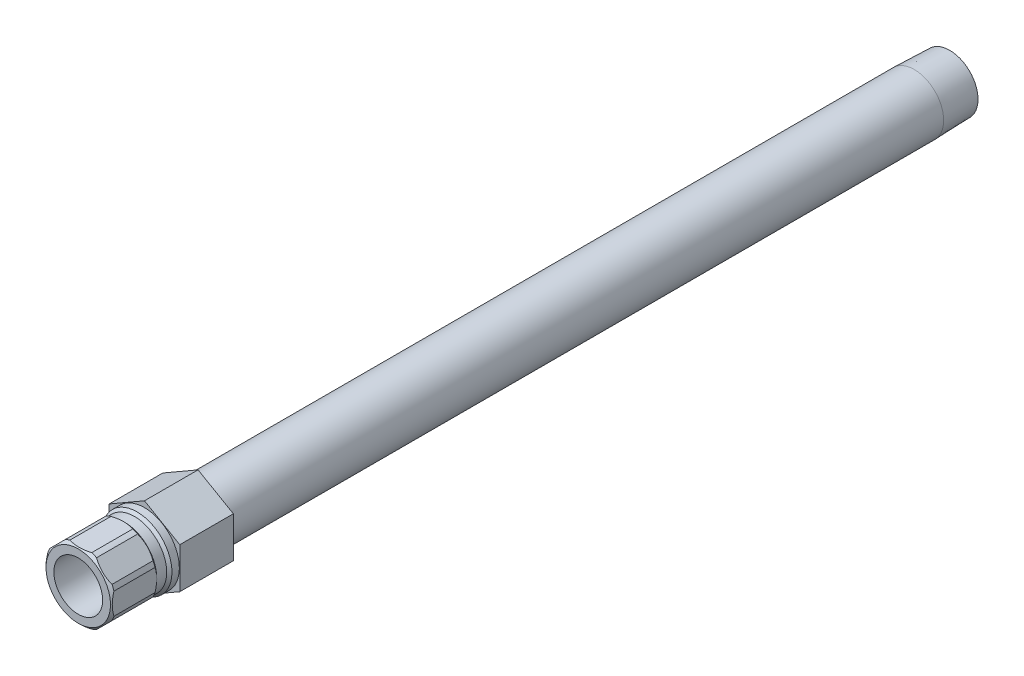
ISO-10303-21;
HEADER;
FILE_DESCRIPTION(('STEP AP214'),'2;1');
FILE_NAME('part.step','',(''),(''),'','','');
FILE_SCHEMA(('AUTOMOTIVE_DESIGN { 1 0 10303 214 1 1 1 1 }'));
ENDSEC;
DATA;
#1=APPLICATION_CONTEXT('core data for automotive mechanical design processes');
#2=APPLICATION_PROTOCOL_DEFINITION('international standard','automotive_design',2000,#1);
#3=PRODUCT_CONTEXT('',#1,'mechanical');
#4=PRODUCT('Part','Part','',(#3));
#5=PRODUCT_RELATED_PRODUCT_CATEGORY('part','',(#4));
#6=PRODUCT_DEFINITION_FORMATION('','',#4);
#7=PRODUCT_DEFINITION_CONTEXT('part definition',#1,'design');
#8=PRODUCT_DEFINITION('design','',#6,#7);
#9=PRODUCT_DEFINITION_SHAPE('','',#8);
#10=(LENGTH_UNIT() NAMED_UNIT(*) SI_UNIT(.MILLI.,.METRE.));
#11=(NAMED_UNIT(*) PLANE_ANGLE_UNIT() SI_UNIT($,.RADIAN.));
#12=(NAMED_UNIT(*) SI_UNIT($,.STERADIAN.) SOLID_ANGLE_UNIT());
#13=UNCERTAINTY_MEASURE_WITH_UNIT(LENGTH_MEASURE(1.E-05),#10,'distance_accuracy_value','');
#14=(GEOMETRIC_REPRESENTATION_CONTEXT(3) GLOBAL_UNCERTAINTY_ASSIGNED_CONTEXT((#13)) GLOBAL_UNIT_ASSIGNED_CONTEXT((#10,
#11,#12)) REPRESENTATION_CONTEXT('',''));
#15=CARTESIAN_POINT('',(0.,0.,0.));
#16=DIRECTION('',(0.,0.,1.));
#17=DIRECTION('',(1.,0.,0.));
#18=AXIS2_PLACEMENT_3D('',#15,#16,#17);
#19=CARTESIAN_POINT('',(0.,0.,0.));
#20=DIRECTION('',(0.,0.,-1.));
#21=DIRECTION('',(0.,1.,0.));
#22=AXIS2_PLACEMENT_3D('',#19,#20,#21);
#23=CYLINDRICAL_SURFACE('',#22,10.16);
#24=DIRECTION('',(0.,0.,-1.));
#25=VECTOR('',#24,1.);
#26=CARTESIAN_POINT('',(9.06826191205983,-4.58172739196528,0.));
#27=LINE('',#26,#25);
#28=CARTESIAN_POINT('',(9.06826191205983,-4.58172739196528,6.5786));
#29=VERTEX_POINT('',#28);
#30=CARTESIAN_POINT('',(9.06826191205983,-4.58172739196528,18.542));
#31=VERTEX_POINT('',#30);
#32=EDGE_CURVE('E525',#29,#31,#27,.F.);
#33=ORIENTED_EDGE('',*,*,#32,.F.);
#34=CARTESIAN_POINT('',(0.,0.,6.5786));
#35=DIRECTION('',(0.,0.,-1.));
#36=DIRECTION('',(0.,1.,0.));
#37=AXIS2_PLACEMENT_3D('',#34,#35,#36);
#38=CIRCLE('',#37,10.16);
#39=CARTESIAN_POINT('',(9.652,-3.17245898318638,6.5786));
#40=VERTEX_POINT('',#39);
#41=EDGE_CURVE('E216',#40,#29,#38,.T.);
#42=ORIENTED_EDGE('',*,*,#41,.F.);
#43=DIRECTION('',(0.,0.,-1.));
#44=VECTOR('',#43,1.);
#45=CARTESIAN_POINT('',(9.652,-3.17245898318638,0.));
#46=LINE('',#45,#44);
#47=CARTESIAN_POINT('',(9.652,-3.17245898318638,18.542));
#48=VERTEX_POINT('',#47);
#49=EDGE_CURVE('E404',#48,#40,#46,.T.);
#50=ORIENTED_EDGE('',*,*,#49,.F.);
#51=CARTESIAN_POINT('',(0.,0.,18.542));
#52=DIRECTION('',(0.,0.,-1.));
#53=DIRECTION('',(0.,1.,0.));
#54=AXIS2_PLACEMENT_3D('',#51,#52,#53);
#55=CIRCLE('',#54,10.16);
#56=EDGE_CURVE('E418',#48,#31,#55,.T.);
#57=ORIENTED_EDGE('',*,*,#56,.T.);
#58=EDGE_LOOP('',(#33,#42,#50,#57));
#59=FACE_BOUND('',#58,.T.);
#60=ADVANCED_FACE('F36',(#59),#23,.T.);
#61=DIRECTION('',(0.,0.,-1.));
#62=VECTOR('',#61,1.);
#63=CARTESIAN_POINT('',(9.652,3.17245898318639,0.));
#64=LINE('',#63,#62);
#65=CARTESIAN_POINT('',(9.652,3.1724589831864,6.57859999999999));
#66=VERTEX_POINT('',#65);
#67=CARTESIAN_POINT('',(9.652,3.17245898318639,18.542));
#68=VERTEX_POINT('',#67);
#69=EDGE_CURVE('E325',#66,#68,#64,.F.);
#70=ORIENTED_EDGE('',*,*,#69,.F.);
#71=CARTESIAN_POINT('',(9.06826191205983,4.58172739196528,6.5786));
#72=VERTEX_POINT('',#71);
#73=EDGE_CURVE('E219',#72,#66,#38,.T.);
#74=ORIENTED_EDGE('',*,*,#73,.F.);
#75=DIRECTION('',(0.,0.,-1.));
#76=VECTOR('',#75,1.);
#77=CARTESIAN_POINT('',(9.06826191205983,4.58172739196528,0.));
#78=LINE('',#77,#76);
#79=CARTESIAN_POINT('',(9.06826191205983,4.58172739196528,18.542));
#80=VERTEX_POINT('',#79);
#81=EDGE_CURVE('E397',#80,#72,#78,.T.);
#82=ORIENTED_EDGE('',*,*,#81,.F.);
#83=EDGE_CURVE('E233',#80,#68,#55,.T.);
#84=ORIENTED_EDGE('',*,*,#83,.T.);
#85=EDGE_LOOP('',(#70,#74,#82,#84));
#86=FACE_BOUND('',#85,.T.);
#87=ADVANCED_FACE('F419',(#86),#23,.T.);
#88=DIRECTION('',(0.,0.,-1.));
#89=VECTOR('',#88,1.);
#90=CARTESIAN_POINT('',(4.58172739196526,9.06826191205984,0.));
#91=LINE('',#90,#89);
#92=CARTESIAN_POINT('',(4.58172739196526,9.06826191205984,6.5786));
#93=VERTEX_POINT('',#92);
#94=CARTESIAN_POINT('',(4.58172739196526,9.06826191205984,18.542));
#95=VERTEX_POINT('',#94);
#96=EDGE_CURVE('E398',#93,#95,#91,.F.);
#97=ORIENTED_EDGE('',*,*,#96,.F.);
#98=CARTESIAN_POINT('',(3.17245898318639,9.652,6.5786));
#99=VERTEX_POINT('',#98);
#100=EDGE_CURVE('E221',#99,#93,#38,.T.);
#101=ORIENTED_EDGE('',*,*,#100,.F.);
#102=DIRECTION('',(0.,0.,-1.));
#103=VECTOR('',#102,1.);
#104=CARTESIAN_POINT('',(3.17245898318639,9.652,0.));
#105=LINE('',#104,#103);
#106=CARTESIAN_POINT('',(3.17245898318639,9.652,18.542));
#107=VERTEX_POINT('',#106);
#108=EDGE_CURVE('E391',#107,#99,#105,.T.);
#109=ORIENTED_EDGE('',*,*,#108,.F.);
#110=EDGE_CURVE('E229',#107,#95,#55,.T.);
#111=ORIENTED_EDGE('',*,*,#110,.T.);
#112=EDGE_LOOP('',(#97,#101,#109,#111));
#113=FACE_BOUND('',#112,.T.);
#114=ADVANCED_FACE('F438',(#113),#23,.T.);
#115=DIRECTION('',(0.,0.,-1.));
#116=VECTOR('',#115,1.);
#117=CARTESIAN_POINT('',(-3.17245898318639,9.652,0.));
#118=LINE('',#117,#116);
#119=CARTESIAN_POINT('',(-3.17245898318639,9.652,6.5786));
#120=VERTEX_POINT('',#119);
#121=CARTESIAN_POINT('',(-3.17245898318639,9.652,18.542));
#122=VERTEX_POINT('',#121);
#123=EDGE_CURVE('E392',#120,#122,#118,.F.);
#124=ORIENTED_EDGE('',*,*,#123,.F.);
#125=CARTESIAN_POINT('',(-4.58172739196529,9.06826191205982,6.5786));
#126=VERTEX_POINT('',#125);
#127=EDGE_CURVE('E226',#126,#120,#38,.T.);
#128=ORIENTED_EDGE('',*,*,#127,.F.);
#129=DIRECTION('',(0.,0.,-1.));
#130=VECTOR('',#129,1.);
#131=CARTESIAN_POINT('',(-4.58172739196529,9.06826191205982,0.));
#132=LINE('',#131,#130);
#133=CARTESIAN_POINT('',(-4.58172739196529,9.06826191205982,18.542));
#134=VERTEX_POINT('',#133);
#135=EDGE_CURVE('E56',#134,#126,#132,.T.);
#136=ORIENTED_EDGE('',*,*,#135,.F.);
#137=EDGE_CURVE('E225',#134,#122,#55,.T.);
#138=ORIENTED_EDGE('',*,*,#137,.T.);
#139=EDGE_LOOP('',(#124,#128,#136,#138));
#140=FACE_BOUND('',#139,.T.);
#141=ADVANCED_FACE('F433',(#140),#23,.T.);
#142=DIRECTION('',(0.,0.,-1.));
#143=VECTOR('',#142,1.);
#144=CARTESIAN_POINT('',(-9.06826191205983,4.58172739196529,0.));
#145=LINE('',#144,#143);
#146=CARTESIAN_POINT('',(-9.06826191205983,4.58172739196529,6.5786));
#147=VERTEX_POINT('',#146);
#148=CARTESIAN_POINT('',(-9.06826191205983,4.58172739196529,18.542));
#149=VERTEX_POINT('',#148);
#150=EDGE_CURVE('E388',#147,#149,#145,.F.);
#151=ORIENTED_EDGE('',*,*,#150,.F.);
#152=CARTESIAN_POINT('',(-9.652,3.17245898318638,6.5786));
#153=VERTEX_POINT('',#152);
#154=EDGE_CURVE('E441',#153,#147,#38,.T.);
#155=ORIENTED_EDGE('',*,*,#154,.F.);
#156=DIRECTION('',(0.,0.,-1.));
#157=VECTOR('',#156,1.);
#158=CARTESIAN_POINT('',(-9.652,3.17245898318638,0.));
#159=LINE('',#158,#157);
#160=CARTESIAN_POINT('',(-9.652,3.17245898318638,18.542));
#161=VERTEX_POINT('',#160);
#162=EDGE_CURVE('E64',#161,#153,#159,.T.);
#163=ORIENTED_EDGE('',*,*,#162,.F.);
#164=EDGE_CURVE('E424',#161,#149,#55,.T.);
#165=ORIENTED_EDGE('',*,*,#164,.T.);
#166=EDGE_LOOP('',(#151,#155,#163,#165));
#167=FACE_BOUND('',#166,.T.);
#168=ADVANCED_FACE('F546',(#167),#23,.T.);
#169=DIRECTION('',(0.,0.,-1.));
#170=VECTOR('',#169,1.);
#171=CARTESIAN_POINT('',(-9.652,-3.17245898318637,0.));
#172=LINE('',#171,#170);
#173=CARTESIAN_POINT('',(-9.652,-3.17245898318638,6.5786));
#174=VERTEX_POINT('',#173);
#175=CARTESIAN_POINT('',(-9.652,-3.17245898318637,18.542));
#176=VERTEX_POINT('',#175);
#177=EDGE_CURVE('E386',#174,#176,#172,.F.);
#178=ORIENTED_EDGE('',*,*,#177,.F.);
#179=CARTESIAN_POINT('',(-9.06826191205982,-4.58172739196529,6.5786));
#180=VERTEX_POINT('',#179);
#181=EDGE_CURVE('E220',#180,#174,#38,.T.);
#182=ORIENTED_EDGE('',*,*,#181,.F.);
#183=DIRECTION('',(0.,0.,-1.));
#184=VECTOR('',#183,1.);
#185=CARTESIAN_POINT('',(-9.06826191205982,-4.58172739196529,0.));
#186=LINE('',#185,#184);
#187=CARTESIAN_POINT('',(-9.06826191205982,-4.58172739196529,18.542));
#188=VERTEX_POINT('',#187);
#189=EDGE_CURVE('E263',#188,#180,#186,.T.);
#190=ORIENTED_EDGE('',*,*,#189,.F.);
#191=EDGE_CURVE('E422',#188,#176,#55,.T.);
#192=ORIENTED_EDGE('',*,*,#191,.T.);
#193=EDGE_LOOP('',(#178,#182,#190,#192));
#194=FACE_BOUND('',#193,.T.);
#195=ADVANCED_FACE('F539',(#194),#23,.T.);
#196=DIRECTION('',(0.,0.,-1.));
#197=VECTOR('',#196,1.);
#198=CARTESIAN_POINT('',(-4.58172739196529,-9.06826191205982,0.));
#199=LINE('',#198,#197);
#200=CARTESIAN_POINT('',(-4.58172739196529,-9.06826191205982,6.5786));
#201=VERTEX_POINT('',#200);
#202=CARTESIAN_POINT('',(-4.58172739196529,-9.06826191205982,18.542));
#203=VERTEX_POINT('',#202);
#204=EDGE_CURVE('E376',#201,#203,#199,.F.);
#205=ORIENTED_EDGE('',*,*,#204,.F.);
#206=CARTESIAN_POINT('',(-3.17245898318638,-9.652,6.5786));
#207=VERTEX_POINT('',#206);
#208=EDGE_CURVE('E217',#207,#201,#38,.T.);
#209=ORIENTED_EDGE('',*,*,#208,.F.);
#210=DIRECTION('',(0.,0.,-1.));
#211=VECTOR('',#210,1.);
#212=CARTESIAN_POINT('',(-3.17245898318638,-9.652,0.));
#213=LINE('',#212,#211);
#214=CARTESIAN_POINT('',(-3.17245898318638,-9.652,18.542));
#215=VERTEX_POINT('',#214);
#216=EDGE_CURVE('E194',#215,#207,#213,.T.);
#217=ORIENTED_EDGE('',*,*,#216,.F.);
#218=EDGE_CURVE('E385',#215,#203,#55,.T.);
#219=ORIENTED_EDGE('',*,*,#218,.T.);
#220=EDGE_LOOP('',(#205,#209,#217,#219));
#221=FACE_BOUND('',#220,.T.);
#222=ADVANCED_FACE('F383',(#221),#23,.T.);
#223=CARTESIAN_POINT('',(0.,0.,0.));
#224=DIRECTION('',(0.,0.,-1.));
#225=DIRECTION('',(0.,1.,0.));
#226=AXIS2_PLACEMENT_3D('',#223,#224,#225);
#227=CYLINDRICAL_SURFACE('',#226,8.5725);
#228=CARTESIAN_POINT('',(0.,0.,-224.3582));
#229=DIRECTION('',(0.,0.,-1.));
#230=DIRECTION('',(0.,1.,0.));
#231=AXIS2_PLACEMENT_3D('',#228,#229,#230);
#232=CIRCLE('',#231,8.57250000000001);
#233=CARTESIAN_POINT('',(0.,8.5725,-224.3582));
#234=VERTEX_POINT('',#233);
#235=EDGE_CURVE('E456',#234,#234,#232,.T.);
#236=ORIENTED_EDGE('',*,*,#235,.F.);
#237=EDGE_LOOP('',(#236));
#238=FACE_BOUND('',#237,.T.);
#239=CARTESIAN_POINT('',(0.,0.,-15.621));
#240=DIRECTION('',(0.,0.,1.));
#241=DIRECTION('',(1.,0.,0.));
#242=AXIS2_PLACEMENT_3D('',#239,#240,#241);
#243=CIRCLE('',#242,8.5725);
#244=CARTESIAN_POINT('',(8.5725,0.,-15.621));
#245=VERTEX_POINT('',#244);
#246=EDGE_CURVE('E471',#245,#245,#243,.F.);
#247=ORIENTED_EDGE('',*,*,#246,.T.);
#248=EDGE_LOOP('',(#247));
#249=FACE_BOUND('',#248,.T.);
#250=ADVANCED_FACE('F538',(#238,#249),#227,.T.);
#251=CARTESIAN_POINT('',(0.,0.,0.));
#252=DIRECTION('',(0.,0.,-1.));
#253=DIRECTION('',(0.,1.,0.));
#254=AXIS2_PLACEMENT_3D('',#251,#252,#253);
#255=CYLINDRICAL_SURFACE('',#254,7.112);
#256=CARTESIAN_POINT('',(0.,0.,1.524));
#257=DIRECTION('',(0.,0.,-1.));
#258=DIRECTION('',(0.,1.,0.));
#259=AXIS2_PLACEMENT_3D('',#256,#257,#258);
#260=CIRCLE('',#259,7.112);
#261=CARTESIAN_POINT('',(0.,7.112,1.524));
#262=VERTEX_POINT('',#261);
#263=EDGE_CURVE('E468',#262,#262,#260,.T.);
#264=ORIENTED_EDGE('',*,*,#263,.T.);
#265=EDGE_LOOP('',(#264));
#266=FACE_BOUND('',#265,.T.);
#267=CARTESIAN_POINT('',(0.,0.,19.304));
#268=DIRECTION('',(0.,0.,-1.));
#269=DIRECTION('',(0.,1.,0.));
#270=AXIS2_PLACEMENT_3D('',#267,#268,#269);
#271=CIRCLE('',#270,7.112);
#272=CARTESIAN_POINT('',(0.,7.112,19.304));
#273=VERTEX_POINT('',#272);
#274=EDGE_CURVE('E200',#273,#273,#271,.T.);
#275=ORIENTED_EDGE('',*,*,#274,.F.);
#276=EDGE_LOOP('',(#275));
#277=FACE_BOUND('',#276,.T.);
#278=ADVANCED_FACE('F38',(#266,#277),#255,.F.);
#279=CARTESIAN_POINT('',(0.,7.112,19.304));
#280=DIRECTION('',(0.,0.,1.));
#281=DIRECTION('',(0.,-1.,0.));
#282=AXIS2_PLACEMENT_3D('',#279,#280,#281);
#283=PLANE('',#282);
#284=ORIENTED_EDGE('',*,*,#274,.T.);
#285=EDGE_LOOP('',(#284));
#286=FACE_BOUND('',#285,.T.);
#287=CARTESIAN_POINT('',(0.,0.,19.304));
#288=DIRECTION('',(0.,0.,-1.));
#289=DIRECTION('',(0.,1.,0.));
#290=AXIS2_PLACEMENT_3D('',#287,#288,#289);
#291=CIRCLE('',#290,9.398);
#292=CARTESIAN_POINT('',(0.,9.398,19.304));
#293=VERTEX_POINT('',#292);
#294=EDGE_CURVE('E232',#293,#293,#291,.T.);
#295=ORIENTED_EDGE('',*,*,#294,.F.);
#296=EDGE_LOOP('',(#295));
#297=FACE_BOUND('',#296,.T.);
#298=ADVANCED_FACE('F269',(#286,#297),#283,.T.);
#299=CARTESIAN_POINT('',(0.,0.,18.542));
#300=DIRECTION('',(0.,0.,-1.));
#301=DIRECTION('',(0.,1.,0.));
#302=AXIS2_PLACEMENT_3D('',#299,#300,#301);
#303=CONICAL_SURFACE('',#302,10.16,0.785398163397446);
#304=CARTESIAN_POINT('',(9.06871478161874,-4.58127452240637,18.5418));
#305=CARTESIAN_POINT('',(8.89746651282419,-4.75252279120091,18.6174888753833));
#306=CARTESIAN_POINT('',(8.72454398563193,-4.92544531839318,18.6860001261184));
#307=CARTESIAN_POINT('',(8.37571487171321,-5.2742744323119,18.8068689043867));
#308=CARTESIAN_POINT('',(8.19980528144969,-5.45018402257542,18.85920901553));
#309=CARTESIAN_POINT('',(7.8498282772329,-5.80016102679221,18.9447662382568));
#310=CARTESIAN_POINT('',(7.67581225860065,-5.97417704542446,18.9783973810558));
#311=CARTESIAN_POINT('',(7.32656572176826,-6.32342358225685,19.0270891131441));
#312=CARTESIAN_POINT('',(7.15133584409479,-6.49865345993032,19.0421588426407));
#313=CARTESIAN_POINT('',(6.77605057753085,-6.87393872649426,19.0538859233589));
#314=CARTESIAN_POINT('',(6.57594647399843,-7.07404283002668,19.0476773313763));
#315=CARTESIAN_POINT('',(6.17675989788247,-7.47322940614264,19.0106603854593));
#316=CARTESIAN_POINT('',(5.97767829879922,-7.67231100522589,18.9798336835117));
#317=CARTESIAN_POINT('',(5.57666706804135,-8.07332223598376,18.8939894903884));
#318=CARTESIAN_POINT('',(5.37480504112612,-8.27518426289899,18.8383431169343));
#319=CARTESIAN_POINT('',(5.07491153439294,-8.57507776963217,18.7386783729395));
#320=CARTESIAN_POINT('',(4.97548345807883,-8.67450584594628,18.7027814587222));
#321=CARTESIAN_POINT('',(4.77762502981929,-8.87236427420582,18.6259657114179));
#322=CARTESIAN_POINT('',(4.67919445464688,-8.97079484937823,18.5850480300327));
#323=CARTESIAN_POINT('',(4.58127452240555,-9.06871478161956,18.5417999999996));
#324=B_SPLINE_CURVE_WITH_KNOTS('',3,(#304,#305,#306,#307,#308,#309,#310,#311,#312,#313,#314,
#315,#316,#317,#318,#319,#320,#321,#322,#323),.UNSPECIFIED.,.F.,.F.,(4,2,2,2,2,2,2,2,2,4),(0.,
0.761268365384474,1.52335378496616,2.26782503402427,3.01192953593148,3.85997332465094,
4.70864975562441,5.58017277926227,6.01546212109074,6.4506517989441),.UNSPECIFIED.);
#325=CARTESIAN_POINT('',(4.58172739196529,-9.06826191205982,18.542));
#326=VERTEX_POINT('',#325);
#327=EDGE_CURVE('E506',#31,#326,#324,.T.);
#328=ORIENTED_EDGE('',*,*,#327,.F.);
#329=ORIENTED_EDGE('',*,*,#56,.F.);
#330=CARTESIAN_POINT('',(9.652,-7.71050187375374,16.3483388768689));
#331=CARTESIAN_POINT('',(9.652,-7.52475481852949,16.4642553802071));
#332=CARTESIAN_POINT('',(9.652,-7.33786285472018,16.5783624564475));
#333=CARTESIAN_POINT('',(9.652,-6.96152272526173,16.8023812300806));
#334=CARTESIAN_POINT('',(9.652,-6.77207395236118,16.9122919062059));
#335=CARTESIAN_POINT('',(9.652,-6.38961701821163,17.1277502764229));
#336=CARTESIAN_POINT('',(9.652,-6.19659699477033,17.2332770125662));
#337=CARTESIAN_POINT('',(9.652,-5.80760245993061,17.4386922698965));
#338=CARTESIAN_POINT('',(9.652,-5.6116281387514,17.5385811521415));
#339=CARTESIAN_POINT('',(9.652,-5.01021259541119,17.8328232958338));
#340=CARTESIAN_POINT('',(9.652,-4.59965798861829,18.0169416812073));
#341=CARTESIAN_POINT('',(9.652,-3.76461195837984,18.3488686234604));
#342=CARTESIAN_POINT('',(9.652,-3.34014745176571,18.4967430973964));
#343=CARTESIAN_POINT('',(9.652,-2.66836152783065,18.6905975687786));
#344=CARTESIAN_POINT('',(9.652,-2.42567962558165,18.7527238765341));
#345=CARTESIAN_POINT('',(9.652,-1.9366245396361,18.860517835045));
#346=CARTESIAN_POINT('',(9.652,-1.69025117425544,18.9061846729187));
#347=CARTESIAN_POINT('',(9.652,-1.1971622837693,18.9790662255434));
#348=CARTESIAN_POINT('',(9.652,-0.95047238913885,19.0064526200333));
#349=CARTESIAN_POINT('',(9.652,-0.45571021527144,19.0423990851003));
#350=CARTESIAN_POINT('',(9.652,-0.207637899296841,19.0509586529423));
#351=CARTESIAN_POINT('',(9.652,0.333683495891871,19.048681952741));
#352=CARTESIAN_POINT('',(9.652,0.626923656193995,19.0340251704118));
#353=CARTESIAN_POINT('',(9.652,1.21094277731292,18.9786837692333));
#354=CARTESIAN_POINT('',(9.652,1.501721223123,18.9379938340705));
#355=CARTESIAN_POINT('',(9.652,2.08266136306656,18.8320509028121));
#356=CARTESIAN_POINT('',(9.652,2.3727646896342,18.7664820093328));
#357=CARTESIAN_POINT('',(9.652,2.94714147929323,18.6138865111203));
#358=CARTESIAN_POINT('',(9.652,3.23141585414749,18.5268632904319));
#359=CARTESIAN_POINT('',(9.652,3.82869981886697,18.3226103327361));
#360=CARTESIAN_POINT('',(9.652,4.14087760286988,18.2029681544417));
#361=CARTESIAN_POINT('',(9.652,4.75742701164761,17.9448741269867));
#362=CARTESIAN_POINT('',(9.652,5.0617950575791,17.8064138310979));
#363=CARTESIAN_POINT('',(9.652,5.66409479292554,17.5139015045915));
#364=CARTESIAN_POINT('',(9.652,5.96200267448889,17.3598008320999));
#365=CARTESIAN_POINT('',(9.652,6.55107386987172,17.0393844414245));
#366=CARTESIAN_POINT('',(9.652,6.84223818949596,16.8730705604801));
#367=CARTESIAN_POINT('',(9.652,7.40668231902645,16.5376791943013));
#368=CARTESIAN_POINT('',(9.652,7.68020242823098,16.3690040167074));
#369=CARTESIAN_POINT('',(9.652,8.22250898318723,16.0241853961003));
#370=CARTESIAN_POINT('',(9.652,8.49129505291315,15.848041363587));
#371=CARTESIAN_POINT('',(9.652,9.02258177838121,15.4910339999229));
#372=CARTESIAN_POINT('',(9.652,9.28511552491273,15.3102197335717));
#373=CARTESIAN_POINT('',(9.652,9.80652727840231,14.9435456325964));
#374=CARTESIAN_POINT('',(9.652,10.0654063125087,14.7576872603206));
#375=CARTESIAN_POINT('',(9.652,10.3227473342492,14.5697596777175));
#376=B_SPLINE_CURVE_WITH_KNOTS('',3,(#330,#331,#332,#333,#334,#335,#336,#337,#338,#339,#340,
#341,#342,#343,#344,#345,#346,#347,#348,#349,#350,#351,#352,#353,#354,#355,#356,#357,#358,#359,
#360,#361,#362,#363,#364,#365,#366,#367,#368,#369,#370,#371,#372,#373,#374,#375),.UNSPECIFIED.,
.F.,.F.,(4,2,2,2,2,2,2,2,2,2,2,2,2,2,2,2,2,2,2,2,2,2,4),(0.,0.656855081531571,1.31386901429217,
1.97372850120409,2.63354568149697,3.98211483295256,5.32821282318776,6.07925616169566,
6.83033658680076,7.5742601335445,8.31820354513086,9.1977741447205,10.0775244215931,
10.9688407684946,11.8600166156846,12.8622077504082,13.8648502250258,14.8707124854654,
15.8764237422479,16.8403261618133,17.8043048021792,18.7605668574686,19.7165545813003),.UNSPECIFIED.);
#377=EDGE_CURVE('E317',#68,#48,#376,.F.);
#378=ORIENTED_EDGE('',*,*,#377,.F.);
#379=ORIENTED_EDGE('',*,*,#83,.F.);
#380=CARTESIAN_POINT('',(4.58127452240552,9.06871478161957,18.5417999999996));
#381=CARTESIAN_POINT('',(4.75252279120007,8.89746651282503,18.617488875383));
#382=CARTESIAN_POINT('',(4.92544531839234,8.72454398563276,18.6860001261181));
#383=CARTESIAN_POINT('',(5.27427443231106,8.37571487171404,18.8068689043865));
#384=CARTESIAN_POINT('',(5.45018402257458,8.19980528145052,18.8592090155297));
#385=CARTESIAN_POINT('',(5.80016102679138,7.84982827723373,18.9447662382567));
#386=CARTESIAN_POINT('',(5.97417704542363,7.67581225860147,18.9783973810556));
#387=CARTESIAN_POINT('',(6.32342358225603,7.32656572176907,19.027089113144));
#388=CARTESIAN_POINT('',(6.4986534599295,7.1513358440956,19.0421588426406));
#389=CARTESIAN_POINT('',(6.87393872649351,6.77605057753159,19.0538859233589));
#390=CARTESIAN_POINT('',(7.074042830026,6.57594647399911,19.0476773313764));
#391=CARTESIAN_POINT('',(7.4732294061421,6.17675989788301,19.0106603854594));
#392=CARTESIAN_POINT('',(7.67231100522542,5.97767829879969,18.9798336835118));
#393=CARTESIAN_POINT('',(8.07332223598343,5.57666706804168,18.8939894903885));
#394=CARTESIAN_POINT('',(8.27518426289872,5.37480504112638,18.8383431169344));
#395=CARTESIAN_POINT('',(8.57507776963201,5.07491153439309,18.7386783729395));
#396=CARTESIAN_POINT('',(8.67450584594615,4.97548345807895,18.7027814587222));
#397=CARTESIAN_POINT('',(8.87236427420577,4.77762502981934,18.6259657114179));
#398=CARTESIAN_POINT('',(8.9707948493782,4.6791944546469,18.5850480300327));
#399=CARTESIAN_POINT('',(9.06871478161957,4.58127452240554,18.5417999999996));
#400=B_SPLINE_CURVE_WITH_KNOTS('',3,(#380,#381,#382,#383,#384,#385,#386,#387,#388,#389,#390,
#391,#392,#393,#394,#395,#396,#397,#398,#399),.UNSPECIFIED.,.F.,.F.,(4,2,2,2,2,2,2,2,2,4),(0.,
0.761268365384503,1.52335378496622,2.26782503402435,3.01192953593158,3.85997332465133,
4.70864975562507,5.58017277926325,6.01546212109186,6.45065179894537),.UNSPECIFIED.);
#401=EDGE_CURVE('E309',#95,#80,#400,.T.);
#402=ORIENTED_EDGE('',*,*,#401,.F.);
#403=ORIENTED_EDGE('',*,*,#110,.F.);
#404=CARTESIAN_POINT('',(-7.71050187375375,9.652,16.3483388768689));
#405=CARTESIAN_POINT('',(-7.5247548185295,9.652,16.4642553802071));
#406=CARTESIAN_POINT('',(-7.33786285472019,9.652,16.5783624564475));
#407=CARTESIAN_POINT('',(-6.96152272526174,9.652,16.8023812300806));
#408=CARTESIAN_POINT('',(-6.77207395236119,9.652,16.9122919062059));
#409=CARTESIAN_POINT('',(-6.38961701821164,9.652,17.1277502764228));
#410=CARTESIAN_POINT('',(-6.19659699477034,9.652,17.2332770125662));
#411=CARTESIAN_POINT('',(-5.80760245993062,9.652,17.4386922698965));
#412=CARTESIAN_POINT('',(-5.61162813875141,9.652,17.5385811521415));
#413=CARTESIAN_POINT('',(-5.0102125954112,9.652,17.8328232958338));
#414=CARTESIAN_POINT('',(-4.5996579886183,9.652,18.0169416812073));
#415=CARTESIAN_POINT('',(-3.76461195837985,9.652,18.3488686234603));
#416=CARTESIAN_POINT('',(-3.34014745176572,9.652,18.4967430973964));
#417=CARTESIAN_POINT('',(-2.66836152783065,9.652,18.6905975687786));
#418=CARTESIAN_POINT('',(-2.42567962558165,9.652,18.7527238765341));
#419=CARTESIAN_POINT('',(-1.9366245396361,9.652,18.860517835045));
#420=CARTESIAN_POINT('',(-1.69025117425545,9.652,18.9061846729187));
#421=CARTESIAN_POINT('',(-1.19716228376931,9.652,18.9790662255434));
#422=CARTESIAN_POINT('',(-0.950472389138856,9.652,19.0064526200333));
#423=CARTESIAN_POINT('',(-0.455710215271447,9.652,19.0423990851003));
#424=CARTESIAN_POINT('',(-0.207637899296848,9.652,19.0509586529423));
#425=CARTESIAN_POINT('',(0.333683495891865,9.652,19.048681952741));
#426=CARTESIAN_POINT('',(0.626923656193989,9.652,19.0340251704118));
#427=CARTESIAN_POINT('',(1.21094277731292,9.652,18.9786837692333));
#428=CARTESIAN_POINT('',(1.50172122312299,9.652,18.9379938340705));
#429=CARTESIAN_POINT('',(2.08266136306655,9.652,18.8320509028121));
#430=CARTESIAN_POINT('',(2.3727646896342,9.652,18.7664820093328));
#431=CARTESIAN_POINT('',(2.94714147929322,9.652,18.6138865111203));
#432=CARTESIAN_POINT('',(3.23141585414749,9.652,18.5268632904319));
#433=CARTESIAN_POINT('',(3.82869981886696,9.652,18.3226103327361));
#434=CARTESIAN_POINT('',(4.14087760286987,9.652,18.2029681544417));
#435=CARTESIAN_POINT('',(4.7574270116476,9.652,17.9448741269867));
#436=CARTESIAN_POINT('',(5.06179505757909,9.652,17.8064138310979));
#437=CARTESIAN_POINT('',(5.66409479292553,9.652,17.5139015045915));
#438=CARTESIAN_POINT('',(5.96200267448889,9.652,17.3598008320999));
#439=CARTESIAN_POINT('',(6.55107386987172,9.652,17.0393844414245));
#440=CARTESIAN_POINT('',(6.84223818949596,9.652,16.8730705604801));
#441=CARTESIAN_POINT('',(7.40668231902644,9.652,16.5376791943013));
#442=CARTESIAN_POINT('',(7.68020242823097,9.652,16.3690040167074));
#443=CARTESIAN_POINT('',(8.22250898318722,9.652,16.0241853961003));
#444=CARTESIAN_POINT('',(8.49129505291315,9.652,15.848041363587));
#445=CARTESIAN_POINT('',(9.0225817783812,9.652,15.4910339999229));
#446=CARTESIAN_POINT('',(9.28511552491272,9.652,15.3102197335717));
#447=CARTESIAN_POINT('',(9.8065272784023,9.652,14.9435456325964));
#448=CARTESIAN_POINT('',(10.0654063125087,9.652,14.7576872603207));
#449=CARTESIAN_POINT('',(10.3227473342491,9.652,14.5697596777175));
#450=B_SPLINE_CURVE_WITH_KNOTS('',3,(#404,#405,#406,#407,#408,#409,#410,#411,#412,#413,#414,
#415,#416,#417,#418,#419,#420,#421,#422,#423,#424,#425,#426,#427,#428,#429,#430,#431,#432,#433,
#434,#435,#436,#437,#438,#439,#440,#441,#442,#443,#444,#445,#446,#447,#448,#449),.UNSPECIFIED.,
.F.,.F.,(4,2,2,2,2,2,2,2,2,2,2,2,2,2,2,2,2,2,2,2,2,2,4),(0.,0.656855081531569,1.31386901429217,
1.97372850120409,2.63354568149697,3.98211483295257,5.32821282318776,6.07925616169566,
6.83033658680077,7.57426013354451,8.31820354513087,9.1977741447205,10.0775244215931,
10.9688407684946,11.8600166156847,12.8622077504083,13.8648502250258,14.8707124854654,
15.8764237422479,16.8403261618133,17.8043048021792,18.7605668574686,19.7165545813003),.UNSPECIFIED.);
#451=EDGE_CURVE('E301',#122,#107,#450,.T.);
#452=ORIENTED_EDGE('',*,*,#451,.F.);
#453=ORIENTED_EDGE('',*,*,#137,.F.);
#454=CARTESIAN_POINT('',(-9.06871478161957,4.58127452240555,18.5417999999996));
#455=CARTESIAN_POINT('',(-8.89746651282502,4.75252279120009,18.617488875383));
#456=CARTESIAN_POINT('',(-8.72454398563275,4.92544531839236,18.6860001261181));
#457=CARTESIAN_POINT('',(-8.37571487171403,5.27427443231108,18.8068689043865));
#458=CARTESIAN_POINT('',(-8.19980528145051,5.4501840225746,18.8592090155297));
#459=CARTESIAN_POINT('',(-7.84982827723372,5.80016102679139,18.9447662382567));
#460=CARTESIAN_POINT('',(-7.67581225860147,5.97417704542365,18.9783973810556));
#461=CARTESIAN_POINT('',(-7.32656572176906,6.32342358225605,19.027089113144));
#462=CARTESIAN_POINT('',(-7.15133584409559,6.49865345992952,19.0421588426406));
#463=CARTESIAN_POINT('',(-6.77605057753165,6.87393872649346,19.0538859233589));
#464=CARTESIAN_POINT('',(-6.57594647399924,7.07404283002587,19.0476773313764));
#465=CARTESIAN_POINT('',(-6.17675989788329,7.47322940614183,19.0106603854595));
#466=CARTESIAN_POINT('',(-5.97767829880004,7.67231100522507,18.9798336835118));
#467=CARTESIAN_POINT('',(-5.57666706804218,8.07332223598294,18.8939894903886));
#468=CARTESIAN_POINT('',(-5.37480504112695,8.27518426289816,18.8383431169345));
#469=CARTESIAN_POINT('',(-5.07491153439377,8.57507776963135,18.7386783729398));
#470=CARTESIAN_POINT('',(-4.97548345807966,8.67450584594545,18.7027814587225));
#471=CARTESIAN_POINT('',(-4.77762502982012,8.872364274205,18.6259657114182));
#472=CARTESIAN_POINT('',(-4.67919445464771,8.9707948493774,18.585048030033));
#473=CARTESIAN_POINT('',(-4.58127452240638,9.06871478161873,18.5418));
#474=B_SPLINE_CURVE_WITH_KNOTS('',3,(#454,#455,#456,#457,#458,#459,#460,#461,#462,#463,#464,
#465,#466,#467,#468,#469,#470,#471,#472,#473),.UNSPECIFIED.,.F.,.F.,(4,2,2,2,2,2,2,2,2,4),(0.,
0.761268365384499,1.52335378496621,2.26782503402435,3.01192953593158,3.85997332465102,
4.70864975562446,5.5801727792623,6.01546212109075,6.4506517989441),.UNSPECIFIED.);
#475=EDGE_CURVE('E292',#149,#134,#474,.T.);
#476=ORIENTED_EDGE('',*,*,#475,.F.);
#477=ORIENTED_EDGE('',*,*,#164,.F.);
#478=CARTESIAN_POINT('',(-9.652,-7.71050187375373,16.3483388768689));
#479=CARTESIAN_POINT('',(-9.652,-7.52475481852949,16.4642553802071));
#480=CARTESIAN_POINT('',(-9.652,-7.33786285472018,16.5783624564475));
#481=CARTESIAN_POINT('',(-9.652,-6.96152272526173,16.8023812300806));
#482=CARTESIAN_POINT('',(-9.652,-6.77207395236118,16.9122919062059));
#483=CARTESIAN_POINT('',(-9.652,-6.38961701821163,17.1277502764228));
#484=CARTESIAN_POINT('',(-9.652,-6.19659699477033,17.2332770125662));
#485=CARTESIAN_POINT('',(-9.652,-5.8076024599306,17.4386922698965));
#486=CARTESIAN_POINT('',(-9.652,-5.6116281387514,17.5385811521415));
#487=CARTESIAN_POINT('',(-9.652,-5.01021259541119,17.8328232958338));
#488=CARTESIAN_POINT('',(-9.652,-4.59965798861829,18.0169416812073));
#489=CARTESIAN_POINT('',(-9.652,-3.76461195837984,18.3488686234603));
#490=CARTESIAN_POINT('',(-9.652,-3.34014745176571,18.4967430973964));
#491=CARTESIAN_POINT('',(-9.652,-2.66836152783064,18.6905975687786));
#492=CARTESIAN_POINT('',(-9.652,-2.42567962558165,18.7527238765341));
#493=CARTESIAN_POINT('',(-9.652,-1.9366245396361,18.860517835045));
#494=CARTESIAN_POINT('',(-9.652,-1.69025117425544,18.9061846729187));
#495=CARTESIAN_POINT('',(-9.652,-1.1971622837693,18.9790662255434));
#496=CARTESIAN_POINT('',(-9.652,-0.950472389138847,19.0064526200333));
#497=CARTESIAN_POINT('',(-9.652,-0.455710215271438,19.0423990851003));
#498=CARTESIAN_POINT('',(-9.652,-0.207637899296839,19.0509586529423));
#499=CARTESIAN_POINT('',(-9.652,0.333683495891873,19.048681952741));
#500=CARTESIAN_POINT('',(-9.652,0.626923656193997,19.0340251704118));
#501=CARTESIAN_POINT('',(-9.652,1.21094277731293,18.9786837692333));
#502=CARTESIAN_POINT('',(-9.652,1.501721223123,18.9379938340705));
#503=CARTESIAN_POINT('',(-9.652,2.08266136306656,18.8320509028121));
#504=CARTESIAN_POINT('',(-9.652,2.3727646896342,18.7664820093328));
#505=CARTESIAN_POINT('',(-9.652,2.94714147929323,18.6138865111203));
#506=CARTESIAN_POINT('',(-9.652,3.23141585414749,18.5268632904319));
#507=CARTESIAN_POINT('',(-9.652,3.82869981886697,18.3226103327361));
#508=CARTESIAN_POINT('',(-9.652,4.14087760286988,18.2029681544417));
#509=CARTESIAN_POINT('',(-9.652,4.75742701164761,17.9448741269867));
#510=CARTESIAN_POINT('',(-9.652,5.0617950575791,17.8064138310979));
#511=CARTESIAN_POINT('',(-9.652,5.66409479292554,17.5139015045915));
#512=CARTESIAN_POINT('',(-9.652,5.9620026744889,17.3598008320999));
#513=CARTESIAN_POINT('',(-9.652,6.55107386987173,17.0393844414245));
#514=CARTESIAN_POINT('',(-9.652,6.84223818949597,16.8730705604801));
#515=CARTESIAN_POINT('',(-9.652,7.40668231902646,16.5376791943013));
#516=CARTESIAN_POINT('',(-9.652,7.68020242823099,16.3690040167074));
#517=CARTESIAN_POINT('',(-9.652,8.22250898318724,16.0241853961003));
#518=CARTESIAN_POINT('',(-9.652,8.49129505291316,15.848041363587));
#519=CARTESIAN_POINT('',(-9.652,9.02258177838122,15.4910339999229));
#520=CARTESIAN_POINT('',(-9.652,9.28511552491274,15.3102197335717));
#521=CARTESIAN_POINT('',(-9.652,9.80652727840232,14.9435456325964));
#522=CARTESIAN_POINT('',(-9.652,10.0654063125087,14.7576872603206));
#523=CARTESIAN_POINT('',(-9.652,10.3227473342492,14.5697596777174));
#524=B_SPLINE_CURVE_WITH_KNOTS('',3,(#478,#479,#480,#481,#482,#483,#484,#485,#486,#487,#488,
#489,#490,#491,#492,#493,#494,#495,#496,#497,#498,#499,#500,#501,#502,#503,#504,#505,#506,#507,
#508,#509,#510,#511,#512,#513,#514,#515,#516,#517,#518,#519,#520,#521,#522,#523),.UNSPECIFIED.,
.F.,.F.,(4,2,2,2,2,2,2,2,2,2,2,2,2,2,2,2,2,2,2,2,2,2,4),(0.,0.656855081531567,1.31386901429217,
1.97372850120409,2.63354568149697,3.98211483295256,5.32821282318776,6.07925616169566,
6.83033658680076,7.5742601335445,8.31820354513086,9.1977741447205,10.0775244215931,
10.9688407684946,11.8600166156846,12.8622077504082,13.8648502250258,14.8707124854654,
15.8764237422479,16.8403261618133,17.8043048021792,18.7605668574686,19.7165545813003),.UNSPECIFIED.);
#525=EDGE_CURVE('E284',#176,#161,#524,.T.);
#526=ORIENTED_EDGE('',*,*,#525,.F.);
#527=ORIENTED_EDGE('',*,*,#191,.F.);
#528=CARTESIAN_POINT('',(-4.58127452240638,-9.06871478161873,18.5418));
#529=CARTESIAN_POINT('',(-4.75252279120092,-8.89746651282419,18.6174888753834));
#530=CARTESIAN_POINT('',(-4.92544531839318,-8.72454398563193,18.6860001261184));
#531=CARTESIAN_POINT('',(-5.2742744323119,-8.37571487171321,18.8068689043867));
#532=CARTESIAN_POINT('',(-5.45018402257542,-8.19980528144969,18.85920901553));
#533=CARTESIAN_POINT('',(-5.80016102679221,-7.8498282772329,18.9447662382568));
#534=CARTESIAN_POINT('',(-5.97417704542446,-7.67581225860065,18.9783973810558));
#535=CARTESIAN_POINT('',(-6.32342358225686,-7.32656572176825,19.0270891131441));
#536=CARTESIAN_POINT('',(-6.49865345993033,-7.15133584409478,19.0421588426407));
#537=CARTESIAN_POINT('',(-6.87393872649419,-6.77605057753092,19.0538859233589));
#538=CARTESIAN_POINT('',(-7.07404283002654,-6.57594647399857,19.0476773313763));
#539=CARTESIAN_POINT('',(-7.47322940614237,-6.17675989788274,19.0106603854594));
#540=CARTESIAN_POINT('',(-7.67231100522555,-5.97767829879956,18.9798336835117));
#541=CARTESIAN_POINT('',(-8.07332223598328,-5.57666706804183,18.8939894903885));
#542=CARTESIAN_POINT('',(-8.27518426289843,-5.37480504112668,18.8383431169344));
#543=CARTESIAN_POINT('',(-8.57507776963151,-5.0749115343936,18.7386783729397));
#544=CARTESIAN_POINT('',(-8.67450584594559,-4.97548345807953,18.7027814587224));
#545=CARTESIAN_POINT('',(-8.87236427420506,-4.77762502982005,18.6259657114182));
#546=CARTESIAN_POINT('',(-8.97079484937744,-4.67919445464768,18.585048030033));
#547=CARTESIAN_POINT('',(-9.06871478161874,-4.58127452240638,18.5418));
#548=B_SPLINE_CURVE_WITH_KNOTS('',3,(#528,#529,#530,#531,#532,#533,#534,#535,#536,#537,#538,
#539,#540,#541,#542,#543,#544,#545,#546,#547),.UNSPECIFIED.,.F.,.F.,(4,2,2,2,2,2,2,2,2,4),(0.,
0.761268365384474,1.52335378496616,2.26782503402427,3.01192953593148,3.85997332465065,
4.70864975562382,5.58017277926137,6.01546212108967,6.45065179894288),.UNSPECIFIED.);
#549=EDGE_CURVE('E277',#203,#188,#548,.T.);
#550=ORIENTED_EDGE('',*,*,#549,.F.);
#551=ORIENTED_EDGE('',*,*,#218,.F.);
#552=CARTESIAN_POINT('',(-7.71050187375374,-9.652,16.3483388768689));
#553=CARTESIAN_POINT('',(-7.52475481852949,-9.652,16.4642553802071));
#554=CARTESIAN_POINT('',(-7.33786285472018,-9.652,16.5783624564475));
#555=CARTESIAN_POINT('',(-6.96152272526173,-9.652,16.8023812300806));
#556=CARTESIAN_POINT('',(-6.77207395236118,-9.652,16.9122919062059));
#557=CARTESIAN_POINT('',(-6.38961701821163,-9.652,17.1277502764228));
#558=CARTESIAN_POINT('',(-6.19659699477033,-9.652,17.2332770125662));
#559=CARTESIAN_POINT('',(-5.80760245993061,-9.652,17.4386922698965));
#560=CARTESIAN_POINT('',(-5.6116281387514,-9.652,17.5385811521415));
#561=CARTESIAN_POINT('',(-5.01021259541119,-9.652,17.8328232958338));
#562=CARTESIAN_POINT('',(-4.59965798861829,-9.652,18.0169416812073));
#563=CARTESIAN_POINT('',(-3.76461195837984,-9.652,18.3488686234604));
#564=CARTESIAN_POINT('',(-3.34014745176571,-9.652,18.4967430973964));
#565=CARTESIAN_POINT('',(-2.66836152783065,-9.652,18.6905975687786));
#566=CARTESIAN_POINT('',(-2.42567962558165,-9.652,18.7527238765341));
#567=CARTESIAN_POINT('',(-1.9366245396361,-9.652,18.860517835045));
#568=CARTESIAN_POINT('',(-1.69025117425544,-9.652,18.9061846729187));
#569=CARTESIAN_POINT('',(-1.1971622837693,-9.652,18.9790662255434));
#570=CARTESIAN_POINT('',(-0.950472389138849,-9.652,19.0064526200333));
#571=CARTESIAN_POINT('',(-0.45571021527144,-9.652,19.0423990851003));
#572=CARTESIAN_POINT('',(-0.20763789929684,-9.652,19.0509586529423));
#573=CARTESIAN_POINT('',(0.333683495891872,-9.652,19.048681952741));
#574=CARTESIAN_POINT('',(0.626923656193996,-9.652,19.0340251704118));
#575=CARTESIAN_POINT('',(1.21094277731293,-9.652,18.9786837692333));
#576=CARTESIAN_POINT('',(1.501721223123,-9.652,18.9379938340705));
#577=CARTESIAN_POINT('',(2.08266136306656,-9.652,18.8320509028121));
#578=CARTESIAN_POINT('',(2.3727646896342,-9.652,18.7664820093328));
#579=CARTESIAN_POINT('',(2.94714147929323,-9.652,18.6138865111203));
#580=CARTESIAN_POINT('',(3.23141585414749,-9.652,18.5268632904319));
#581=CARTESIAN_POINT('',(3.82869981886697,-9.652,18.3226103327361));
#582=CARTESIAN_POINT('',(4.14087760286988,-9.652,18.2029681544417));
#583=CARTESIAN_POINT('',(4.75742701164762,-9.652,17.9448741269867));
#584=CARTESIAN_POINT('',(5.0617950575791,-9.652,17.8064138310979));
#585=CARTESIAN_POINT('',(5.66409479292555,-9.652,17.5139015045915));
#586=CARTESIAN_POINT('',(5.9620026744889,-9.652,17.3598008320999));
#587=CARTESIAN_POINT('',(6.55107386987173,-9.652,17.0393844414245));
#588=CARTESIAN_POINT('',(6.84223818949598,-9.652,16.8730705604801));
#589=CARTESIAN_POINT('',(7.40668231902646,-9.652,16.5376791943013));
#590=CARTESIAN_POINT('',(7.68020242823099,-9.652,16.3690040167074));
#591=CARTESIAN_POINT('',(8.22250898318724,-9.652,16.0241853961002));
#592=CARTESIAN_POINT('',(8.49129505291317,-9.652,15.848041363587));
#593=CARTESIAN_POINT('',(9.02258177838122,-9.652,15.4910339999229));
#594=CARTESIAN_POINT('',(9.28511552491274,-9.652,15.3102197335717));
#595=CARTESIAN_POINT('',(9.80652727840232,-9.652,14.9435456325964));
#596=CARTESIAN_POINT('',(10.0654063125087,-9.652,14.7576872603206));
#597=CARTESIAN_POINT('',(10.3227473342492,-9.652,14.5697596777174));
#598=B_SPLINE_CURVE_WITH_KNOTS('',3,(#552,#553,#554,#555,#556,#557,#558,#559,#560,#561,#562,
#563,#564,#565,#566,#567,#568,#569,#570,#571,#572,#573,#574,#575,#576,#577,#578,#579,#580,#581,
#582,#583,#584,#585,#586,#587,#588,#589,#590,#591,#592,#593,#594,#595,#596,#597),.UNSPECIFIED.,
.F.,.F.,(4,2,2,2,2,2,2,2,2,2,2,2,2,2,2,2,2,2,2,2,2,2,4),(0.,0.656855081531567,1.31386901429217,
1.97372850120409,2.63354568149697,3.98211483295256,5.32821282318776,6.07925616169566,
6.83033658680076,7.5742601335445,8.31820354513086,9.1977741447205,10.0775244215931,
10.9688407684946,11.8600166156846,12.8622077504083,13.8648502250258,14.8707124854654,
15.8764237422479,16.8403261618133,17.8043048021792,18.7605668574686,19.7165545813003),.UNSPECIFIED.);
#599=CARTESIAN_POINT('',(3.17245898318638,-9.652,18.542));
#600=VERTEX_POINT('',#599);
#601=EDGE_CURVE('E210',#600,#215,#598,.F.);
#602=ORIENTED_EDGE('',*,*,#601,.F.);
#603=EDGE_CURVE('E209',#326,#600,#55,.T.);
#604=ORIENTED_EDGE('',*,*,#603,.F.);
#605=EDGE_LOOP('',(#328,#329,#378,#379,#402,#403,#452,#453,#476,#477,#526,#527,#550,#551,#602,#604));
#606=FACE_BOUND('',#605,.T.);
#607=ORIENTED_EDGE('',*,*,#294,.T.);
#608=EDGE_LOOP('',(#607));
#609=FACE_BOUND('',#608,.T.);
#610=ADVANCED_FACE('F266',(#606,#609),#303,.T.);
#611=DIRECTION('',(0.,0.,-1.));
#612=VECTOR('',#611,1.);
#613=CARTESIAN_POINT('',(4.58172739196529,-9.06826191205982,0.));
#614=LINE('',#613,#612);
#615=CARTESIAN_POINT('',(4.58172739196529,-9.06826191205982,6.5786));
#616=VERTEX_POINT('',#615);
#617=EDGE_CURVE('E324',#326,#616,#614,.T.);
#618=ORIENTED_EDGE('',*,*,#617,.F.);
#619=ORIENTED_EDGE('',*,*,#603,.T.);
#620=DIRECTION('',(0.,0.,-1.));
#621=VECTOR('',#620,1.);
#622=CARTESIAN_POINT('',(3.17245898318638,-9.652,0.));
#623=LINE('',#622,#621);
#624=CARTESIAN_POINT('',(3.1724589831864,-9.652,6.57859999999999));
#625=VERTEX_POINT('',#624);
#626=EDGE_CURVE('E191',#625,#600,#623,.F.);
#627=ORIENTED_EDGE('',*,*,#626,.F.);
#628=EDGE_CURVE('E207',#616,#625,#38,.T.);
#629=ORIENTED_EDGE('',*,*,#628,.F.);
#630=EDGE_LOOP('',(#618,#619,#627,#629));
#631=FACE_BOUND('',#630,.T.);
#632=ADVANCED_FACE('F206',(#631),#23,.T.);
#633=CARTESIAN_POINT('',(0.,0.,5.8166));
#634=DIRECTION('',(0.,0.,1.));
#635=DIRECTION('',(0.,-1.,0.));
#636=AXIS2_PLACEMENT_3D('',#633,#634,#635);
#637=CONICAL_SURFACE('',#636,9.398,0.785398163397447);
#638=CARTESIAN_POINT('',(4.58127452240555,-9.06871478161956,6.57880000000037));
#639=CARTESIAN_POINT('',(4.75252279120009,-8.89746651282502,6.50311112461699));
#640=CARTESIAN_POINT('',(4.92544531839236,-8.72454398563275,6.4345998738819));
#641=CARTESIAN_POINT('',(5.27427443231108,-8.37571487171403,6.31373109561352));
#642=CARTESIAN_POINT('',(5.4501840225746,-8.19980528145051,6.26139098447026));
#643=CARTESIAN_POINT('',(5.8001610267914,-7.84982827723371,6.17583376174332));
#644=CARTESIAN_POINT('',(5.97417704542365,-7.67581225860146,6.14220261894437));
#645=CARTESIAN_POINT('',(6.32342358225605,-7.32656572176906,6.09351088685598));
#646=CARTESIAN_POINT('',(6.49865345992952,-7.15133584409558,6.07844115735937));
#647=CARTESIAN_POINT('',(6.87393872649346,-6.77605057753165,6.06671407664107));
#648=CARTESIAN_POINT('',(7.07404283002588,-6.57594647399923,6.07292266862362));
#649=CARTESIAN_POINT('',(7.47322940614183,-6.17675989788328,6.10993961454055));
#650=CARTESIAN_POINT('',(7.67231100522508,-5.97767829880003,6.14076631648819));
#651=CARTESIAN_POINT('',(8.07332223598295,-5.57666706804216,6.22661050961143));
#652=CARTESIAN_POINT('',(8.27518426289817,-5.37480504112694,6.28225688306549));
#653=CARTESIAN_POINT('',(8.57507776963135,-5.07491153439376,6.38192162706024));
#654=CARTESIAN_POINT('',(8.67450584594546,-4.97548345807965,6.41781854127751));
#655=CARTESIAN_POINT('',(8.872364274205,-4.77762502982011,6.49463428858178));
#656=CARTESIAN_POINT('',(8.97079484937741,-4.6791944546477,6.53555196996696));
#657=CARTESIAN_POINT('',(9.06871478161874,-4.58127452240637,6.5788));
#658=B_SPLINE_CURVE_WITH_KNOTS('',3,(#638,#639,#640,#641,#642,#643,#644,#645,#646,#647,#648,
#649,#650,#651,#652,#653,#654,#655,#656,#657),.UNSPECIFIED.,.F.,.F.,(4,2,2,2,2,2,2,2,2,4),(0.,
0.761268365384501,1.52335378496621,2.26782503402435,3.01192953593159,3.85997332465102,
4.70864975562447,5.58017277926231,6.01546212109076,6.45065179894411),.UNSPECIFIED.);
#659=EDGE_CURVE('E12',#616,#29,#658,.T.);
#660=ORIENTED_EDGE('',*,*,#659,.F.);
#661=ORIENTED_EDGE('',*,*,#628,.T.);
#662=CARTESIAN_POINT('',(-7.71050187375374,-9.652,8.77226112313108));
#663=CARTESIAN_POINT('',(-7.52475481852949,-9.652,8.65634461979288));
#664=CARTESIAN_POINT('',(-7.33786285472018,-9.652,8.54223754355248));
#665=CARTESIAN_POINT('',(-6.96152272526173,-9.652,8.31821876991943));
#666=CARTESIAN_POINT('',(-6.77207395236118,-9.652,8.20830809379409));
#667=CARTESIAN_POINT('',(-6.38961701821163,-9.652,7.99284972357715));
#668=CARTESIAN_POINT('',(-6.19659699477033,-9.652,7.88732298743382));
#669=CARTESIAN_POINT('',(-5.80760245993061,-9.652,7.6819077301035));
#670=CARTESIAN_POINT('',(-5.6116281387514,-9.652,7.58201884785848));
#671=CARTESIAN_POINT('',(-5.0102125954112,-9.652,7.28777670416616));
#672=CARTESIAN_POINT('',(-4.59965798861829,-9.652,7.10365831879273));
#673=CARTESIAN_POINT('',(-3.76461195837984,-9.652,6.77173137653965));
#674=CARTESIAN_POINT('',(-3.34014745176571,-9.652,6.6238569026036));
#675=CARTESIAN_POINT('',(-2.66836152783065,-9.652,6.43000243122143));
#676=CARTESIAN_POINT('',(-2.42567962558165,-9.652,6.36787612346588));
#677=CARTESIAN_POINT('',(-1.9366245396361,-9.652,6.26008216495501));
#678=CARTESIAN_POINT('',(-1.69025117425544,-9.652,6.21441532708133));
#679=CARTESIAN_POINT('',(-1.1971622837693,-9.652,6.1415337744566));
#680=CARTESIAN_POINT('',(-0.950472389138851,-9.652,6.11414737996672));
#681=CARTESIAN_POINT('',(-0.455710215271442,-9.652,6.07820091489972));
#682=CARTESIAN_POINT('',(-0.207637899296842,-9.652,6.06964134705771));
#683=CARTESIAN_POINT('',(0.333683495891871,-9.652,6.07191804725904));
#684=CARTESIAN_POINT('',(0.626923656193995,-9.652,6.08657482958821));
#685=CARTESIAN_POINT('',(1.21094277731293,-9.652,6.14191623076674));
#686=CARTESIAN_POINT('',(1.501721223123,-9.652,6.18260616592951));
#687=CARTESIAN_POINT('',(2.08266136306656,-9.652,6.28854909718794));
#688=CARTESIAN_POINT('',(2.37276468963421,-9.652,6.35411799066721));
#689=CARTESIAN_POINT('',(2.94714147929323,-9.652,6.50671348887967));
#690=CARTESIAN_POINT('',(3.2314158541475,-9.652,6.59373670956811));
#691=CARTESIAN_POINT('',(3.82869981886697,-9.652,6.79798966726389));
#692=CARTESIAN_POINT('',(4.14087760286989,-9.652,6.91763184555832));
#693=CARTESIAN_POINT('',(4.75742701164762,-9.652,7.17572587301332));
#694=CARTESIAN_POINT('',(5.06179505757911,-9.652,7.31418616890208));
#695=CARTESIAN_POINT('',(5.66409479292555,-9.652,7.60669849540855));
#696=CARTESIAN_POINT('',(5.96200267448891,-9.652,7.76079916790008));
#697=CARTESIAN_POINT('',(6.55107386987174,-9.652,8.08121555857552));
#698=CARTESIAN_POINT('',(6.84223818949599,-9.652,8.24752943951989));
#699=CARTESIAN_POINT('',(7.40668231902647,-9.652,8.58292080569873));
#700=CARTESIAN_POINT('',(7.680202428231,-9.652,8.75159598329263));
#701=CARTESIAN_POINT('',(8.22250898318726,-9.652,9.09641460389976));
#702=CARTESIAN_POINT('',(8.49129505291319,-9.652,9.27255863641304));
#703=CARTESIAN_POINT('',(9.02258177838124,-9.652,9.62956600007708));
#704=CARTESIAN_POINT('',(9.28511552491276,-9.652,9.81038026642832));
#705=CARTESIAN_POINT('',(9.80652727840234,-9.652,10.1770543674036));
#706=CARTESIAN_POINT('',(10.0654063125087,-9.652,10.3629127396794));
#707=CARTESIAN_POINT('',(10.3227473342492,-9.652,10.5508403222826));
#708=B_SPLINE_CURVE_WITH_KNOTS('',3,(#662,#663,#664,#665,#666,#667,#668,#669,#670,#671,#672,
#673,#674,#675,#676,#677,#678,#679,#680,#681,#682,#683,#684,#685,#686,#687,#688,#689,#690,#691,
#692,#693,#694,#695,#696,#697,#698,#699,#700,#701,#702,#703,#704,#705,#706,#707),.UNSPECIFIED.,
.F.,.F.,(4,2,2,2,2,2,2,2,2,2,2,2,2,2,2,2,2,2,2,2,2,2,4),(0.,0.656855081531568,1.31386901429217,
1.97372850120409,2.63354568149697,3.98211483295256,5.32821282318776,6.07925616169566,
6.83033658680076,7.5742601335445,8.31820354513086,9.1977741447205,10.0775244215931,
10.9688407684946,11.8600166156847,12.8622077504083,13.8648502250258,14.8707124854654,
15.8764237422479,16.8403261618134,17.8043048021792,18.7605668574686,19.7165545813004),.UNSPECIFIED.);
#709=EDGE_CURVE('E188',#207,#625,#708,.T.);
#710=ORIENTED_EDGE('',*,*,#709,.F.);
#711=ORIENTED_EDGE('',*,*,#208,.T.);
#712=CARTESIAN_POINT('',(-9.06871478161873,-4.58127452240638,6.5788));
#713=CARTESIAN_POINT('',(-8.89746651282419,-4.75252279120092,6.50311112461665));
#714=CARTESIAN_POINT('',(-8.72454398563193,-4.92544531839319,6.43459987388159));
#715=CARTESIAN_POINT('',(-8.37571487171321,-5.2742744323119,6.31373109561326));
#716=CARTESIAN_POINT('',(-8.19980528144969,-5.45018402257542,6.26139098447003));
#717=CARTESIAN_POINT('',(-7.8498282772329,-5.80016102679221,6.17583376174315));
#718=CARTESIAN_POINT('',(-7.67581225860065,-5.97417704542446,6.14220261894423));
#719=CARTESIAN_POINT('',(-7.32656572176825,-6.32342358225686,6.0935108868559));
#720=CARTESIAN_POINT('',(-7.15133584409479,-6.49865345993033,6.07844115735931));
#721=CARTESIAN_POINT('',(-6.77605057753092,-6.87393872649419,6.06671407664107));
#722=CARTESIAN_POINT('',(-6.57594647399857,-7.07404283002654,6.07292266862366));
#723=CARTESIAN_POINT('',(-6.17675989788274,-7.47322940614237,6.10993961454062));
#724=CARTESIAN_POINT('',(-5.97767829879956,-7.67231100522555,6.14076631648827));
#725=CARTESIAN_POINT('',(-5.57666706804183,-8.07332223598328,6.22661050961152));
#726=CARTESIAN_POINT('',(-5.37480504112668,-8.27518426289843,6.28225688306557));
#727=CARTESIAN_POINT('',(-5.0749115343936,-8.57507776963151,6.3819216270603));
#728=CARTESIAN_POINT('',(-4.97548345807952,-8.67450584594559,6.41781854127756));
#729=CARTESIAN_POINT('',(-4.77762502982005,-8.87236427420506,6.49463428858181));
#730=CARTESIAN_POINT('',(-4.67919445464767,-8.97079484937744,6.53555196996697));
#731=CARTESIAN_POINT('',(-4.58127452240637,-9.06871478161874,6.5788));
#732=B_SPLINE_CURVE_WITH_KNOTS('',3,(#712,#713,#714,#715,#716,#717,#718,#719,#720,#721,#722,
#723,#724,#725,#726,#727,#728,#729,#730,#731),.UNSPECIFIED.,.F.,.F.,(4,2,2,2,2,2,2,2,2,4),(0.,
0.761268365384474,1.52335378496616,2.26782503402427,3.01192953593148,3.85997332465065,
4.70864975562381,5.58017277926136,6.01546212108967,6.45065179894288),.UNSPECIFIED.);
#733=EDGE_CURVE('E199',#180,#201,#732,.T.);
#734=ORIENTED_EDGE('',*,*,#733,.F.);
#735=ORIENTED_EDGE('',*,*,#181,.T.);
#736=CARTESIAN_POINT('',(-9.652,-7.71050187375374,8.77226112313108));
#737=CARTESIAN_POINT('',(-9.652,-7.5247548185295,8.65634461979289));
#738=CARTESIAN_POINT('',(-9.652,-7.33786285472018,8.54223754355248));
#739=CARTESIAN_POINT('',(-9.652,-6.96152272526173,8.31821876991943));
#740=CARTESIAN_POINT('',(-9.652,-6.77207395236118,8.2083080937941));
#741=CARTESIAN_POINT('',(-9.652,-6.38961701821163,7.99284972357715));
#742=CARTESIAN_POINT('',(-9.652,-6.19659699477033,7.88732298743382));
#743=CARTESIAN_POINT('',(-9.652,-5.80760245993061,7.6819077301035));
#744=CARTESIAN_POINT('',(-9.652,-5.61162813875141,7.58201884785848));
#745=CARTESIAN_POINT('',(-9.652,-5.0102125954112,7.28777670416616));
#746=CARTESIAN_POINT('',(-9.652,-4.59965798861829,7.10365831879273));
#747=CARTESIAN_POINT('',(-9.652,-3.76461195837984,6.77173137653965));
#748=CARTESIAN_POINT('',(-9.652,-3.34014745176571,6.6238569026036));
#749=CARTESIAN_POINT('',(-9.652,-2.66836152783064,6.43000243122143));
#750=CARTESIAN_POINT('',(-9.652,-2.42567962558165,6.36787612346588));
#751=CARTESIAN_POINT('',(-9.652,-1.9366245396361,6.26008216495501));
#752=CARTESIAN_POINT('',(-9.652,-1.69025117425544,6.21441532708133));
#753=CARTESIAN_POINT('',(-9.652,-1.1971622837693,6.1415337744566));
#754=CARTESIAN_POINT('',(-9.652,-0.950472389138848,6.11414737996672));
#755=CARTESIAN_POINT('',(-9.652,-0.455710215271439,6.07820091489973));
#756=CARTESIAN_POINT('',(-9.652,-0.20763789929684,6.06964134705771));
#757=CARTESIAN_POINT('',(-9.652,0.333683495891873,6.07191804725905));
#758=CARTESIAN_POINT('',(-9.652,0.626923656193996,6.08657482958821));
#759=CARTESIAN_POINT('',(-9.652,1.21094277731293,6.14191623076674));
#760=CARTESIAN_POINT('',(-9.652,1.501721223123,6.18260616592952));
#761=CARTESIAN_POINT('',(-9.652,2.08266136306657,6.28854909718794));
#762=CARTESIAN_POINT('',(-9.652,2.37276468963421,6.35411799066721));
#763=CARTESIAN_POINT('',(-9.652,2.94714147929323,6.50671348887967));
#764=CARTESIAN_POINT('',(-9.652,3.2314158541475,6.59373670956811));
#765=CARTESIAN_POINT('',(-9.652,3.82869981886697,6.79798966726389));
#766=CARTESIAN_POINT('',(-9.652,4.14087760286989,6.91763184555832));
#767=CARTESIAN_POINT('',(-9.652,4.75742701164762,7.17572587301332));
#768=CARTESIAN_POINT('',(-9.652,5.06179505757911,7.31418616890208));
#769=CARTESIAN_POINT('',(-9.652,5.66409479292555,7.60669849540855));
#770=CARTESIAN_POINT('',(-9.652,5.96200267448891,7.76079916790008));
#771=CARTESIAN_POINT('',(-9.652,6.55107386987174,8.08121555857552));
#772=CARTESIAN_POINT('',(-9.652,6.84223818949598,8.24752943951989));
#773=CARTESIAN_POINT('',(-9.652,7.40668231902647,8.58292080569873));
#774=CARTESIAN_POINT('',(-9.652,7.680202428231,8.75159598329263));
#775=CARTESIAN_POINT('',(-9.652,8.22250898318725,9.09641460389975));
#776=CARTESIAN_POINT('',(-9.652,8.49129505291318,9.27255863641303));
#777=CARTESIAN_POINT('',(-9.652,9.02258177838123,9.62956600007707));
#778=CARTESIAN_POINT('',(-9.652,9.28511552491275,9.81038026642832));
#779=CARTESIAN_POINT('',(-9.652,9.80652727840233,10.1770543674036));
#780=CARTESIAN_POINT('',(-9.652,10.0654063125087,10.3629127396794));
#781=CARTESIAN_POINT('',(-9.652,10.3227473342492,10.5508403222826));
#782=B_SPLINE_CURVE_WITH_KNOTS('',3,(#736,#737,#738,#739,#740,#741,#742,#743,#744,#745,#746,
#747,#748,#749,#750,#751,#752,#753,#754,#755,#756,#757,#758,#759,#760,#761,#762,#763,#764,#765,
#766,#767,#768,#769,#770,#771,#772,#773,#774,#775,#776,#777,#778,#779,#780,#781),.UNSPECIFIED.,
.F.,.F.,(4,2,2,2,2,2,2,2,2,2,2,2,2,2,2,2,2,2,2,2,2,2,4),(0.,0.656855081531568,1.31386901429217,
1.97372850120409,2.63354568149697,3.98211483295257,5.32821282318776,6.07925616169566,
6.83033658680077,7.57426013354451,8.31820354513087,9.1977741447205,10.0775244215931,
10.9688407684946,11.8600166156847,12.8622077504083,13.8648502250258,14.8707124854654,
15.8764237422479,16.8403261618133,17.8043048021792,18.7605668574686,19.7165545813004),.UNSPECIFIED.);
#783=EDGE_CURVE('E368',#153,#174,#782,.F.);
#784=ORIENTED_EDGE('',*,*,#783,.F.);
#785=ORIENTED_EDGE('',*,*,#154,.T.);
#786=CARTESIAN_POINT('',(-4.58127452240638,9.06871478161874,6.5788));
#787=CARTESIAN_POINT('',(-4.75252279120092,8.8974665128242,6.50311112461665));
#788=CARTESIAN_POINT('',(-4.92544531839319,8.72454398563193,6.43459987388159));
#789=CARTESIAN_POINT('',(-5.2742744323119,8.37571487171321,6.31373109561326));
#790=CARTESIAN_POINT('',(-5.45018402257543,8.19980528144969,6.26139098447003));
#791=CARTESIAN_POINT('',(-5.80016102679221,7.8498282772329,6.17583376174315));
#792=CARTESIAN_POINT('',(-5.97417704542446,7.67581225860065,6.14220261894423));
#793=CARTESIAN_POINT('',(-6.32342358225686,7.32656572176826,6.0935108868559));
#794=CARTESIAN_POINT('',(-6.49865345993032,7.15133584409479,6.07844115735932));
#795=CARTESIAN_POINT('',(-6.87393872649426,6.77605057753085,6.06671407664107));
#796=CARTESIAN_POINT('',(-7.07404283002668,6.57594647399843,6.07292266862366));
#797=CARTESIAN_POINT('',(-7.47322940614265,6.17675989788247,6.10993961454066));
#798=CARTESIAN_POINT('',(-7.6723110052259,5.97767829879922,6.14076631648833));
#799=CARTESIAN_POINT('',(-8.07332223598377,5.57666706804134,6.22661050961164));
#800=CARTESIAN_POINT('',(-8.27518426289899,5.37480504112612,6.28225688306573));
#801=CARTESIAN_POINT('',(-8.57507776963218,5.07491153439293,6.38192162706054));
#802=CARTESIAN_POINT('',(-8.67450584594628,4.97548345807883,6.41781854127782));
#803=CARTESIAN_POINT('',(-8.87236427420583,4.77762502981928,6.49463428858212));
#804=CARTESIAN_POINT('',(-8.97079484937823,4.67919445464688,6.53555196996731));
#805=CARTESIAN_POINT('',(-9.06871478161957,4.58127452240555,6.57880000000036));
#806=B_SPLINE_CURVE_WITH_KNOTS('',3,(#786,#787,#788,#789,#790,#791,#792,#793,#794,#795,#796,
#797,#798,#799,#800,#801,#802,#803,#804,#805),.UNSPECIFIED.,.F.,.F.,(4,2,2,2,2,2,2,2,2,4),(0.,
0.761268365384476,1.52335378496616,2.26782503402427,3.01192953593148,3.85997332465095,
4.70864975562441,5.58017277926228,6.01546212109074,6.45065179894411),.UNSPECIFIED.);
#807=EDGE_CURVE('E351',#126,#147,#806,.T.);
#808=ORIENTED_EDGE('',*,*,#807,.F.);
#809=ORIENTED_EDGE('',*,*,#127,.T.);
#810=CARTESIAN_POINT('',(-7.71050187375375,9.652,8.77226112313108));
#811=CARTESIAN_POINT('',(-7.52475481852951,9.652,8.65634461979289));
#812=CARTESIAN_POINT('',(-7.3378628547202,9.652,8.54223754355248));
#813=CARTESIAN_POINT('',(-6.96152272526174,9.652,8.31821876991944));
#814=CARTESIAN_POINT('',(-6.7720739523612,9.652,8.2083080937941));
#815=CARTESIAN_POINT('',(-6.38961701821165,9.652,7.99284972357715));
#816=CARTESIAN_POINT('',(-6.19659699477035,9.652,7.88732298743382));
#817=CARTESIAN_POINT('',(-5.80760245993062,9.652,7.6819077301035));
#818=CARTESIAN_POINT('',(-5.61162813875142,9.652,7.58201884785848));
#819=CARTESIAN_POINT('',(-5.0102125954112,9.652,7.28777670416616));
#820=CARTESIAN_POINT('',(-4.5996579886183,9.652,7.10365831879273));
#821=CARTESIAN_POINT('',(-3.76461195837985,9.652,6.77173137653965));
#822=CARTESIAN_POINT('',(-3.34014745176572,9.652,6.6238569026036));
#823=CARTESIAN_POINT('',(-2.66836152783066,9.652,6.43000243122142));
#824=CARTESIAN_POINT('',(-2.42567962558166,9.652,6.36787612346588));
#825=CARTESIAN_POINT('',(-1.93662453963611,9.652,6.260082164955));
#826=CARTESIAN_POINT('',(-1.69025117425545,9.652,6.21441532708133));
#827=CARTESIAN_POINT('',(-1.19716228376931,9.652,6.14153377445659));
#828=CARTESIAN_POINT('',(-0.950472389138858,9.652,6.11414737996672));
#829=CARTESIAN_POINT('',(-0.455710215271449,9.652,6.07820091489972));
#830=CARTESIAN_POINT('',(-0.20763789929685,9.652,6.06964134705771));
#831=CARTESIAN_POINT('',(0.333683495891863,9.652,6.07191804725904));
#832=CARTESIAN_POINT('',(0.626923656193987,9.652,6.08657482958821));
#833=CARTESIAN_POINT('',(1.21094277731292,9.652,6.14191623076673));
#834=CARTESIAN_POINT('',(1.50172122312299,9.652,6.18260616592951));
#835=CARTESIAN_POINT('',(2.08266136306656,9.652,6.28854909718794));
#836=CARTESIAN_POINT('',(2.3727646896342,9.652,6.35411799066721));
#837=CARTESIAN_POINT('',(2.94714147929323,9.652,6.50671348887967));
#838=CARTESIAN_POINT('',(3.23141585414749,9.652,6.59373670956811));
#839=CARTESIAN_POINT('',(3.82869981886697,9.652,6.79798966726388));
#840=CARTESIAN_POINT('',(4.14087760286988,9.652,6.91763184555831));
#841=CARTESIAN_POINT('',(4.75742701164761,9.652,7.17572587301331));
#842=CARTESIAN_POINT('',(5.0617950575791,9.652,7.31418616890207));
#843=CARTESIAN_POINT('',(5.66409479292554,9.652,7.60669849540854));
#844=CARTESIAN_POINT('',(5.9620026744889,9.652,7.76079916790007));
#845=CARTESIAN_POINT('',(6.55107386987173,9.652,8.08121555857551));
#846=CARTESIAN_POINT('',(6.84223818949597,9.652,8.24752943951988));
#847=CARTESIAN_POINT('',(7.40668231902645,9.652,8.58292080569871));
#848=CARTESIAN_POINT('',(7.68020242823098,9.652,8.75159598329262));
#849=CARTESIAN_POINT('',(8.22250898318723,9.652,9.09641460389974));
#850=CARTESIAN_POINT('',(8.49129505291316,9.652,9.27255863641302));
#851=CARTESIAN_POINT('',(9.02258177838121,9.652,9.62956600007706));
#852=CARTESIAN_POINT('',(9.28511552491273,9.652,9.8103802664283));
#853=CARTESIAN_POINT('',(9.80652727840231,9.652,10.1770543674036));
#854=CARTESIAN_POINT('',(10.0654063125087,9.652,10.3629127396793));
#855=CARTESIAN_POINT('',(10.3227473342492,9.652,10.5508403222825));
#856=B_SPLINE_CURVE_WITH_KNOTS('',3,(#810,#811,#812,#813,#814,#815,#816,#817,#818,#819,#820,
#821,#822,#823,#824,#825,#826,#827,#828,#829,#830,#831,#832,#833,#834,#835,#836,#837,#838,#839,
#840,#841,#842,#843,#844,#845,#846,#847,#848,#849,#850,#851,#852,#853,#854,#855),.UNSPECIFIED.,
.F.,.F.,(4,2,2,2,2,2,2,2,2,2,2,2,2,2,2,2,2,2,2,2,2,2,4),(0.,0.656855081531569,1.31386901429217,
1.97372850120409,2.63354568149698,3.98211483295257,5.32821282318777,6.07925616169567,
6.83033658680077,7.57426013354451,8.31820354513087,9.19777414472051,10.0775244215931,
10.9688407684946,11.8600166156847,12.8622077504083,13.8648502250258,14.8707124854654,
15.8764237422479,16.8403261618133,17.8043048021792,18.7605668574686,19.7165545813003),.UNSPECIFIED.);
#857=EDGE_CURVE('E346',#99,#120,#856,.F.);
#858=ORIENTED_EDGE('',*,*,#857,.F.);
#859=ORIENTED_EDGE('',*,*,#100,.T.);
#860=CARTESIAN_POINT('',(9.06871478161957,4.58127452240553,6.57880000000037));
#861=CARTESIAN_POINT('',(8.89746651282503,4.75252279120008,6.50311112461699));
#862=CARTESIAN_POINT('',(8.72454398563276,4.92544531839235,6.4345998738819));
#863=CARTESIAN_POINT('',(8.37571487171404,5.27427443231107,6.31373109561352));
#864=CARTESIAN_POINT('',(8.19980528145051,5.45018402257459,6.26139098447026));
#865=CARTESIAN_POINT('',(7.84982827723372,5.80016102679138,6.17583376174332));
#866=CARTESIAN_POINT('',(7.67581225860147,5.97417704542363,6.14220261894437));
#867=CARTESIAN_POINT('',(7.32656572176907,6.32342358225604,6.09351088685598));
#868=CARTESIAN_POINT('',(7.1513358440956,6.49865345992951,6.07844115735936));
#869=CARTESIAN_POINT('',(6.77605057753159,6.87393872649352,6.06671407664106));
#870=CARTESIAN_POINT('',(6.5759464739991,7.07404283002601,6.07292266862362));
#871=CARTESIAN_POINT('',(6.176759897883,7.4732294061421,6.10993961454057));
#872=CARTESIAN_POINT('',(5.97767829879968,7.67231100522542,6.14076631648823));
#873=CARTESIAN_POINT('',(5.57666706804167,8.07332223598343,6.22661050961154));
#874=CARTESIAN_POINT('',(5.37480504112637,8.27518426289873,6.28225688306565));
#875=CARTESIAN_POINT('',(5.07491153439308,8.57507776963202,6.38192162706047));
#876=CARTESIAN_POINT('',(4.97548345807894,8.67450584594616,6.41781854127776));
#877=CARTESIAN_POINT('',(4.77762502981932,8.87236427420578,6.49463428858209));
#878=CARTESIAN_POINT('',(4.67919445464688,8.97079484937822,6.53555196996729));
#879=CARTESIAN_POINT('',(4.58127452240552,9.06871478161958,6.57880000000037));
#880=B_SPLINE_CURVE_WITH_KNOTS('',3,(#860,#861,#862,#863,#864,#865,#866,#867,#868,#869,#870,
#871,#872,#873,#874,#875,#876,#877,#878,#879),.UNSPECIFIED.,.F.,.F.,(4,2,2,2,2,2,2,2,2,4),(0.,
0.761268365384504,1.52335378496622,2.26782503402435,3.01192953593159,3.85997332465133,
4.70864975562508,5.58017277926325,6.01546212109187,6.45065179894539),.UNSPECIFIED.);
#881=EDGE_CURVE('E341',#72,#93,#880,.T.);
#882=ORIENTED_EDGE('',*,*,#881,.F.);
#883=ORIENTED_EDGE('',*,*,#73,.T.);
#884=CARTESIAN_POINT('',(9.652,-7.71050187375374,8.77226112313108));
#885=CARTESIAN_POINT('',(9.652,-7.5247548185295,8.65634461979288));
#886=CARTESIAN_POINT('',(9.652,-7.33786285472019,8.54223754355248));
#887=CARTESIAN_POINT('',(9.652,-6.96152272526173,8.31821876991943));
#888=CARTESIAN_POINT('',(9.652,-6.77207395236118,8.20830809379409));
#889=CARTESIAN_POINT('',(9.652,-6.38961701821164,7.99284972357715));
#890=CARTESIAN_POINT('',(9.652,-6.19659699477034,7.88732298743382));
#891=CARTESIAN_POINT('',(9.652,-5.80760245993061,7.6819077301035));
#892=CARTESIAN_POINT('',(9.652,-5.61162813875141,7.58201884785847));
#893=CARTESIAN_POINT('',(9.652,-5.0102125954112,7.28777670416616));
#894=CARTESIAN_POINT('',(9.652,-4.59965798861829,7.10365831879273));
#895=CARTESIAN_POINT('',(9.652,-3.76461195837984,6.77173137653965));
#896=CARTESIAN_POINT('',(9.652,-3.34014745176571,6.6238569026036));
#897=CARTESIAN_POINT('',(9.652,-2.66836152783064,6.43000243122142));
#898=CARTESIAN_POINT('',(9.652,-2.42567962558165,6.36787612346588));
#899=CARTESIAN_POINT('',(9.652,-1.9366245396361,6.260082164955));
#900=CARTESIAN_POINT('',(9.652,-1.69025117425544,6.21441532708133));
#901=CARTESIAN_POINT('',(9.652,-1.1971622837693,6.1415337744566));
#902=CARTESIAN_POINT('',(9.652,-0.950472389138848,6.11414737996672));
#903=CARTESIAN_POINT('',(9.652,-0.455710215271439,6.07820091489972));
#904=CARTESIAN_POINT('',(9.652,-0.20763789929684,6.06964134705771));
#905=CARTESIAN_POINT('',(9.652,0.333683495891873,6.07191804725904));
#906=CARTESIAN_POINT('',(9.652,0.626923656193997,6.08657482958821));
#907=CARTESIAN_POINT('',(9.652,1.21094277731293,6.14191623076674));
#908=CARTESIAN_POINT('',(9.652,1.501721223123,6.18260616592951));
#909=CARTESIAN_POINT('',(9.652,2.08266136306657,6.28854909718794));
#910=CARTESIAN_POINT('',(9.652,2.37276468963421,6.35411799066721));
#911=CARTESIAN_POINT('',(9.652,2.94714147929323,6.50671348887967));
#912=CARTESIAN_POINT('',(9.652,3.2314158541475,6.59373670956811));
#913=CARTESIAN_POINT('',(9.652,3.82869981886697,6.79798966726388));
#914=CARTESIAN_POINT('',(9.652,4.14087760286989,6.91763184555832));
#915=CARTESIAN_POINT('',(9.652,4.75742701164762,7.17572587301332));
#916=CARTESIAN_POINT('',(9.652,5.06179505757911,7.31418616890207));
#917=CARTESIAN_POINT('',(9.652,5.66409479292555,7.60669849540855));
#918=CARTESIAN_POINT('',(9.652,5.96200267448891,7.76079916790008));
#919=CARTESIAN_POINT('',(9.652,6.55107386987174,8.08121555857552));
#920=CARTESIAN_POINT('',(9.652,6.84223818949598,8.24752943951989));
#921=CARTESIAN_POINT('',(9.652,7.40668231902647,8.58292080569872));
#922=CARTESIAN_POINT('',(9.652,7.680202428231,8.75159598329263));
#923=CARTESIAN_POINT('',(9.652,8.22250898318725,9.09641460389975));
#924=CARTESIAN_POINT('',(9.652,8.49129505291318,9.27255863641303));
#925=CARTESIAN_POINT('',(9.652,9.02258177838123,9.62956600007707));
#926=CARTESIAN_POINT('',(9.652,9.28511552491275,9.81038026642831));
#927=CARTESIAN_POINT('',(9.652,9.80652727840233,10.1770543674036));
#928=CARTESIAN_POINT('',(9.652,10.0654063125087,10.3629127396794));
#929=CARTESIAN_POINT('',(9.652,10.3227473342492,10.5508403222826));
#930=B_SPLINE_CURVE_WITH_KNOTS('',3,(#884,#885,#886,#887,#888,#889,#890,#891,#892,#893,#894,
#895,#896,#897,#898,#899,#900,#901,#902,#903,#904,#905,#906,#907,#908,#909,#910,#911,#912,#913,
#914,#915,#916,#917,#918,#919,#920,#921,#922,#923,#924,#925,#926,#927,#928,#929),.UNSPECIFIED.,
.F.,.F.,(4,2,2,2,2,2,2,2,2,2,2,2,2,2,2,2,2,2,2,2,2,2,4),(0.,0.656855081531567,1.31386901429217,
1.97372850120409,2.63354568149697,3.98211483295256,5.32821282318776,6.07925616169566,
6.83033658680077,7.57426013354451,8.31820354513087,9.1977741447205,10.0775244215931,
10.9688407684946,11.8600166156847,12.8622077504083,13.8648502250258,14.8707124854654,
15.8764237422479,16.8403261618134,17.8043048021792,18.7605668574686,19.7165545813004),.UNSPECIFIED.);
#931=EDGE_CURVE('E49',#40,#66,#930,.T.);
#932=ORIENTED_EDGE('',*,*,#931,.F.);
#933=ORIENTED_EDGE('',*,*,#41,.T.);
#934=EDGE_LOOP('',(#660,#661,#710,#711,#734,#735,#784,#785,#808,#809,#858,#859,#882,#883,#932,#933));
#935=FACE_BOUND('',#934,.T.);
#936=CARTESIAN_POINT('',(0.,0.,5.8166));
#937=DIRECTION('',(0.,0.,-1.));
#938=DIRECTION('',(0.,1.,0.));
#939=AXIS2_PLACEMENT_3D('',#936,#937,#938);
#940=CIRCLE('',#939,9.398);
#941=CARTESIAN_POINT('',(0.,9.398,5.8166));
#942=VERTEX_POINT('',#941);
#943=EDGE_CURVE('E227',#942,#942,#940,.T.);
#944=ORIENTED_EDGE('',*,*,#943,.F.);
#945=EDGE_LOOP('',(#944));
#946=FACE_BOUND('',#945,.T.);
#947=ADVANCED_FACE('F213',(#935,#946),#637,.T.);
#948=CARTESIAN_POINT('',(0.,0.,0.));
#949=DIRECTION('',(0.,0.,-1.));
#950=DIRECTION('',(0.,1.,0.));
#951=AXIS2_PLACEMENT_3D('',#948,#949,#950);
#952=CYLINDRICAL_SURFACE('',#951,9.398);
#953=ORIENTED_EDGE('',*,*,#943,.T.);
#954=EDGE_LOOP('',(#953));
#955=FACE_BOUND('',#954,.T.);
#956=CARTESIAN_POINT('',(0.,0.,2.921));
#957=DIRECTION('',(0.,0.,-1.));
#958=DIRECTION('',(0.,1.,0.));
#959=AXIS2_PLACEMENT_3D('',#956,#957,#958);
#960=CIRCLE('',#959,9.398);
#961=CARTESIAN_POINT('',(0.,9.398,2.921));
#962=VERTEX_POINT('',#961);
#963=EDGE_CURVE('E443',#962,#962,#960,.T.);
#964=ORIENTED_EDGE('',*,*,#963,.F.);
#965=EDGE_LOOP('',(#964));
#966=FACE_BOUND('',#965,.T.);
#967=ADVANCED_FACE('F536',(#955,#966),#952,.T.);
#968=CARTESIAN_POINT('',(0.,0.,2.159));
#969=DIRECTION('',(0.,0.,-1.));
#970=DIRECTION('',(0.,1.,0.));
#971=AXIS2_PLACEMENT_3D('',#968,#969,#970);
#972=CONICAL_SURFACE('',#971,10.16,0.785398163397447);
#973=ORIENTED_EDGE('',*,*,#963,.T.);
#974=EDGE_LOOP('',(#973));
#975=FACE_BOUND('',#974,.T.);
#976=CARTESIAN_POINT('',(0.,0.,2.159));
#977=DIRECTION('',(0.,0.,-1.));
#978=DIRECTION('',(0.,1.,0.));
#979=AXIS2_PLACEMENT_3D('',#976,#977,#978);
#980=CIRCLE('',#979,10.16);
#981=CARTESIAN_POINT('',(0.,10.16,2.159));
#982=VERTEX_POINT('',#981);
#983=EDGE_CURVE('E447',#982,#982,#980,.T.);
#984=ORIENTED_EDGE('',*,*,#983,.F.);
#985=EDGE_LOOP('',(#984));
#986=FACE_BOUND('',#985,.T.);
#987=ADVANCED_FACE('F704',(#975,#986),#972,.T.);
#988=CARTESIAN_POINT('',(0.,0.,0.));
#989=DIRECTION('',(0.,0.,-1.));
#990=DIRECTION('',(0.,1.,0.));
#991=AXIS2_PLACEMENT_3D('',#988,#989,#990);
#992=CYLINDRICAL_SURFACE('',#991,10.16);
#993=ORIENTED_EDGE('',*,*,#983,.T.);
#994=EDGE_LOOP('',(#993));
#995=FACE_BOUND('',#994,.T.);
#996=CARTESIAN_POINT('',(0.,0.,0.));
#997=DIRECTION('',(0.,0.,-1.));
#998=DIRECTION('',(0.,1.,0.));
#999=AXIS2_PLACEMENT_3D('',#996,#997,#998);
#1000=CIRCLE('',#999,10.16);
#1001=CARTESIAN_POINT('',(0.,10.16,0.));
#1002=VERTEX_POINT('',#1001);
#1003=EDGE_CURVE('E451',#1002,#1002,#1000,.T.);
#1004=ORIENTED_EDGE('',*,*,#1003,.F.);
#1005=EDGE_LOOP('',(#1004));
#1006=FACE_BOUND('',#1005,.T.);
#1007=ADVANCED_FACE('F694',(#995,#1006),#992,.T.);
#1008=CARTESIAN_POINT('',(0.,0.,-234.696));
#1009=DIRECTION('',(0.,0.,1.));
#1010=DIRECTION('',(0.,-1.,0.));
#1011=AXIS2_PLACEMENT_3D('',#1008,#1009,#1010);
#1012=CONICAL_SURFACE('',#1011,8.24944566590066,0.0312396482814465);
#1013=ORIENTED_EDGE('',*,*,#235,.T.);
#1014=EDGE_LOOP('',(#1013));
#1015=FACE_BOUND('',#1014,.T.);
#1016=CARTESIAN_POINT('',(0.,0.,-234.696));
#1017=DIRECTION('',(0.,0.,-1.));
#1018=DIRECTION('',(0.,1.,0.));
#1019=AXIS2_PLACEMENT_3D('',#1016,#1017,#1018);
#1020=CIRCLE('',#1019,8.24944566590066);
#1021=CARTESIAN_POINT('',(0.,8.24944566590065,-234.696));
#1022=VERTEX_POINT('',#1021);
#1023=EDGE_CURVE('E459',#1022,#1022,#1020,.T.);
#1024=ORIENTED_EDGE('',*,*,#1023,.F.);
#1025=EDGE_LOOP('',(#1024));
#1026=FACE_BOUND('',#1025,.T.);
#1027=ADVANCED_FACE('F684',(#1015,#1026),#1012,.T.);
#1028=CARTESIAN_POINT('',(0.,8.24944566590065,-234.696));
#1029=DIRECTION('',(0.,0.,-1.));
#1030=DIRECTION('',(0.,1.,0.));
#1031=AXIS2_PLACEMENT_3D('',#1028,#1029,#1030);
#1032=PLANE('',#1031);
#1033=ORIENTED_EDGE('',*,*,#1023,.T.);
#1034=EDGE_LOOP('',(#1033));
#1035=FACE_BOUND('',#1034,.T.);
#1036=CARTESIAN_POINT('',(0.,0.,-234.696));
#1037=DIRECTION('',(0.,0.,-1.));
#1038=DIRECTION('',(0.,1.,0.));
#1039=AXIS2_PLACEMENT_3D('',#1036,#1037,#1038);
#1040=CIRCLE('',#1039,6.2611);
#1041=CARTESIAN_POINT('',(0.,6.2611,-234.696));
#1042=VERTEX_POINT('',#1041);
#1043=EDGE_CURVE('E462',#1042,#1042,#1040,.T.);
#1044=ORIENTED_EDGE('',*,*,#1043,.F.);
#1045=EDGE_LOOP('',(#1044));
#1046=FACE_BOUND('',#1045,.T.);
#1047=ADVANCED_FACE('F660',(#1035,#1046),#1032,.T.);
#1048=CARTESIAN_POINT('',(0.,0.,0.));
#1049=DIRECTION('',(0.,0.,-1.));
#1050=DIRECTION('',(0.,1.,0.));
#1051=AXIS2_PLACEMENT_3D('',#1048,#1049,#1050);
#1052=CYLINDRICAL_SURFACE('',#1051,6.2611);
#1053=CARTESIAN_POINT('',(0.,0.,0.673100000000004));
#1054=DIRECTION('',(0.,0.,-1.));
#1055=DIRECTION('',(0.,1.,0.));
#1056=AXIS2_PLACEMENT_3D('',#1053,#1054,#1055);
#1057=CIRCLE('',#1056,6.2611);
#1058=CARTESIAN_POINT('',(0.,6.2611,0.673100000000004));
#1059=VERTEX_POINT('',#1058);
#1060=EDGE_CURVE('E465',#1059,#1059,#1057,.T.);
#1061=ORIENTED_EDGE('',*,*,#1060,.F.);
#1062=EDGE_LOOP('',(#1061));
#1063=FACE_BOUND('',#1062,.T.);
#1064=ORIENTED_EDGE('',*,*,#1043,.T.);
#1065=EDGE_LOOP('',(#1064));
#1066=FACE_BOUND('',#1065,.T.);
#1067=ADVANCED_FACE('F655',(#1063,#1066),#1052,.F.);
#1068=CARTESIAN_POINT('',(0.,0.,1.524));
#1069=DIRECTION('',(0.,0.,1.));
#1070=DIRECTION('',(0.,-1.,0.));
#1071=AXIS2_PLACEMENT_3D('',#1068,#1069,#1070);
#1072=CONICAL_SURFACE('',#1071,7.112,0.78539816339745);
#1073=ORIENTED_EDGE('',*,*,#1060,.T.);
#1074=EDGE_LOOP('',(#1073));
#1075=FACE_BOUND('',#1074,.T.);
#1076=ORIENTED_EDGE('',*,*,#263,.F.);
#1077=EDGE_LOOP('',(#1076));
#1078=FACE_BOUND('',#1077,.T.);
#1079=ADVANCED_FACE('F647',(#1075,#1078),#1072,.F.);
#1080=CARTESIAN_POINT('',(0.,11.8784044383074,-15.621));
#1081=DIRECTION('',(-0.5,0.866025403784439,0.));
#1082=DIRECTION('',(-0.866025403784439,-0.5,0.));
#1083=AXIS2_PLACEMENT_3D('',#1080,#1081,#1082);
#1084=PLANE('',#1083);
#1085=DIRECTION('',(-0.866025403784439,-0.5,0.));
#1086=VECTOR('',#1085,1.);
#1087=CARTESIAN_POINT('',(0.,11.8784044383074,0.));
#1088=LINE('',#1087,#1086);
#1089=CARTESIAN_POINT('',(0.,11.8784044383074,0.));
#1090=VERTEX_POINT('',#1089);
#1091=CARTESIAN_POINT('',(-10.287,5.93920221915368,0.));
#1092=VERTEX_POINT('',#1091);
#1093=EDGE_CURVE('E503',#1090,#1092,#1088,.T.);
#1094=ORIENTED_EDGE('',*,*,#1093,.F.);
#1095=DIRECTION('',(0.,0.,1.));
#1096=VECTOR('',#1095,1.);
#1097=CARTESIAN_POINT('',(0.,11.8784044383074,-15.621));
#1098=LINE('',#1097,#1096);
#1099=CARTESIAN_POINT('',(0.,11.8784044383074,-15.621));
#1100=VERTEX_POINT('',#1099);
#1101=EDGE_CURVE('E474',#1100,#1090,#1098,.T.);
#1102=ORIENTED_EDGE('',*,*,#1101,.F.);
#1103=DIRECTION('',(-0.866025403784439,-0.5,0.));
#1104=VECTOR('',#1103,1.);
#1105=CARTESIAN_POINT('',(0.,11.8784044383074,-15.621));
#1106=LINE('',#1105,#1104);
#1107=CARTESIAN_POINT('',(-10.287,5.93920221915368,-15.621));
#1108=VERTEX_POINT('',#1107);
#1109=EDGE_CURVE('E490',#1100,#1108,#1106,.T.);
#1110=ORIENTED_EDGE('',*,*,#1109,.T.);
#1111=DIRECTION('',(0.,0.,1.));
#1112=VECTOR('',#1111,1.);
#1113=CARTESIAN_POINT('',(-10.287,5.93920221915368,-15.621));
#1114=LINE('',#1113,#1112);
#1115=EDGE_CURVE('E475',#1108,#1092,#1114,.T.);
#1116=ORIENTED_EDGE('',*,*,#1115,.T.);
#1117=EDGE_LOOP('',(#1094,#1102,#1110,#1116));
#1118=FACE_BOUND('',#1117,.T.);
#1119=ADVANCED_FACE('F637',(#1118),#1084,.T.);
#1120=CARTESIAN_POINT('',(10.287,5.93920221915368,-15.621));
#1121=DIRECTION('',(0.5,0.866025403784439,0.));
#1122=DIRECTION('',(-0.866025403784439,0.5,0.));
#1123=AXIS2_PLACEMENT_3D('',#1120,#1121,#1122);
#1124=PLANE('',#1123);
#1125=DIRECTION('',(-0.866025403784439,0.5,0.));
#1126=VECTOR('',#1125,1.);
#1127=CARTESIAN_POINT('',(10.287,5.93920221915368,0.));
#1128=LINE('',#1127,#1126);
#1129=CARTESIAN_POINT('',(10.287,5.93920221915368,0.));
#1130=VERTEX_POINT('',#1129);
#1131=EDGE_CURVE('E487',#1130,#1090,#1128,.T.);
#1132=ORIENTED_EDGE('',*,*,#1131,.F.);
#1133=DIRECTION('',(0.,0.,1.));
#1134=VECTOR('',#1133,1.);
#1135=CARTESIAN_POINT('',(10.287,5.93920221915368,-15.621));
#1136=LINE('',#1135,#1134);
#1137=CARTESIAN_POINT('',(10.287,5.93920221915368,-15.621));
#1138=VERTEX_POINT('',#1137);
#1139=EDGE_CURVE('E484',#1138,#1130,#1136,.T.);
#1140=ORIENTED_EDGE('',*,*,#1139,.F.);
#1141=DIRECTION('',(-0.866025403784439,0.5,0.));
#1142=VECTOR('',#1141,1.);
#1143=CARTESIAN_POINT('',(10.287,5.93920221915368,-15.621));
#1144=LINE('',#1143,#1142);
#1145=EDGE_CURVE('E478',#1138,#1100,#1144,.T.);
#1146=ORIENTED_EDGE('',*,*,#1145,.T.);
#1147=ORIENTED_EDGE('',*,*,#1101,.T.);
#1148=EDGE_LOOP('',(#1132,#1140,#1146,#1147));
#1149=FACE_BOUND('',#1148,.T.);
#1150=ADVANCED_FACE('F627',(#1149),#1124,.T.);
#1151=CARTESIAN_POINT('',(10.287,-5.93920221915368,-15.621));
#1152=DIRECTION('',(1.,0.,0.));
#1153=DIRECTION('',(0.,0.,-1.));
#1154=AXIS2_PLACEMENT_3D('',#1151,#1152,#1153);
#1155=PLANE('',#1154);
#1156=DIRECTION('',(0.,1.,0.));
#1157=VECTOR('',#1156,1.);
#1158=CARTESIAN_POINT('',(10.287,-5.93920221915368,0.));
#1159=LINE('',#1158,#1157);
#1160=CARTESIAN_POINT('',(10.287,-5.93920221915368,0.));
#1161=VERTEX_POINT('',#1160);
#1162=EDGE_CURVE('E491',#1161,#1130,#1159,.T.);
#1163=ORIENTED_EDGE('',*,*,#1162,.F.);
#1164=DIRECTION('',(0.,0.,1.));
#1165=VECTOR('',#1164,1.);
#1166=CARTESIAN_POINT('',(10.287,-5.93920221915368,-15.621));
#1167=LINE('',#1166,#1165);
#1168=CARTESIAN_POINT('',(10.287,-5.93920221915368,-15.621));
#1169=VERTEX_POINT('',#1168);
#1170=EDGE_CURVE('E482',#1169,#1161,#1167,.T.);
#1171=ORIENTED_EDGE('',*,*,#1170,.F.);
#1172=DIRECTION('',(0.,1.,0.));
#1173=VECTOR('',#1172,1.);
#1174=CARTESIAN_POINT('',(10.287,-5.93920221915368,-15.621));
#1175=LINE('',#1174,#1173);
#1176=EDGE_CURVE('E509',#1169,#1138,#1175,.T.);
#1177=ORIENTED_EDGE('',*,*,#1176,.T.);
#1178=ORIENTED_EDGE('',*,*,#1139,.T.);
#1179=EDGE_LOOP('',(#1163,#1171,#1177,#1178));
#1180=FACE_BOUND('',#1179,.T.);
#1181=ADVANCED_FACE('F617',(#1180),#1155,.T.);
#1182=CARTESIAN_POINT('',(0.,-11.8784044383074,-15.621));
#1183=DIRECTION('',(0.5,-0.866025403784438,0.));
#1184=DIRECTION('',(0.866025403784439,0.5,0.));
#1185=AXIS2_PLACEMENT_3D('',#1182,#1183,#1184);
#1186=PLANE('',#1185);
#1187=DIRECTION('',(0.866025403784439,0.5,0.));
#1188=VECTOR('',#1187,1.);
#1189=CARTESIAN_POINT('',(0.,-11.8784044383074,0.));
#1190=LINE('',#1189,#1188);
#1191=CARTESIAN_POINT('',(0.,-11.8784044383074,0.));
#1192=VERTEX_POINT('',#1191);
#1193=EDGE_CURVE('E494',#1192,#1161,#1190,.T.);
#1194=ORIENTED_EDGE('',*,*,#1193,.F.);
#1195=DIRECTION('',(0.,0.,1.));
#1196=VECTOR('',#1195,1.);
#1197=CARTESIAN_POINT('',(0.,-11.8784044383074,-15.621));
#1198=LINE('',#1197,#1196);
#1199=CARTESIAN_POINT('',(0.,-11.8784044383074,-15.621));
#1200=VERTEX_POINT('',#1199);
#1201=EDGE_CURVE('E480',#1200,#1192,#1198,.T.);
#1202=ORIENTED_EDGE('',*,*,#1201,.F.);
#1203=DIRECTION('',(0.866025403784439,0.5,0.));
#1204=VECTOR('',#1203,1.);
#1205=CARTESIAN_POINT('',(0.,-11.8784044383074,-15.621));
#1206=LINE('',#1205,#1204);
#1207=EDGE_CURVE('E512',#1200,#1169,#1206,.T.);
#1208=ORIENTED_EDGE('',*,*,#1207,.T.);
#1209=ORIENTED_EDGE('',*,*,#1170,.T.);
#1210=EDGE_LOOP('',(#1194,#1202,#1208,#1209));
#1211=FACE_BOUND('',#1210,.T.);
#1212=ADVANCED_FACE('F607',(#1211),#1186,.T.);
#1213=CARTESIAN_POINT('',(-10.287,-5.93920221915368,-15.621));
#1214=DIRECTION('',(-0.5,-0.866025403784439,0.));
#1215=DIRECTION('',(0.866025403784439,-0.5,0.));
#1216=AXIS2_PLACEMENT_3D('',#1213,#1214,#1215);
#1217=PLANE('',#1216);
#1218=DIRECTION('',(0.866025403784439,-0.5,0.));
#1219=VECTOR('',#1218,1.);
#1220=CARTESIAN_POINT('',(-10.287,-5.93920221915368,0.));
#1221=LINE('',#1220,#1219);
#1222=CARTESIAN_POINT('',(-10.287,-5.93920221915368,0.));
#1223=VERTEX_POINT('',#1222);
#1224=EDGE_CURVE('E497',#1223,#1192,#1221,.T.);
#1225=ORIENTED_EDGE('',*,*,#1224,.F.);
#1226=DIRECTION('',(0.,0.,1.));
#1227=VECTOR('',#1226,1.);
#1228=CARTESIAN_POINT('',(-10.287,-5.93920221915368,-15.621));
#1229=LINE('',#1228,#1227);
#1230=CARTESIAN_POINT('',(-10.287,-5.93920221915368,-15.621));
#1231=VERTEX_POINT('',#1230);
#1232=EDGE_CURVE('E477',#1231,#1223,#1229,.T.);
#1233=ORIENTED_EDGE('',*,*,#1232,.F.);
#1234=DIRECTION('',(0.866025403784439,-0.5,0.));
#1235=VECTOR('',#1234,1.);
#1236=CARTESIAN_POINT('',(-10.287,-5.93920221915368,-15.621));
#1237=LINE('',#1236,#1235);
#1238=EDGE_CURVE('E515',#1231,#1200,#1237,.T.);
#1239=ORIENTED_EDGE('',*,*,#1238,.T.);
#1240=ORIENTED_EDGE('',*,*,#1201,.T.);
#1241=EDGE_LOOP('',(#1225,#1233,#1239,#1240));
#1242=FACE_BOUND('',#1241,.T.);
#1243=ADVANCED_FACE('F597',(#1242),#1217,.T.);
#1244=CARTESIAN_POINT('',(-10.287,5.93920221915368,-15.621));
#1245=DIRECTION('',(-1.,0.,0.));
#1246=DIRECTION('',(0.,-1.,0.));
#1247=AXIS2_PLACEMENT_3D('',#1244,#1245,#1246);
#1248=PLANE('',#1247);
#1249=DIRECTION('',(0.,-1.,0.));
#1250=VECTOR('',#1249,1.);
#1251=CARTESIAN_POINT('',(-10.287,5.93920221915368,0.));
#1252=LINE('',#1251,#1250);
#1253=EDGE_CURVE('E500',#1092,#1223,#1252,.T.);
#1254=ORIENTED_EDGE('',*,*,#1253,.F.);
#1255=ORIENTED_EDGE('',*,*,#1115,.F.);
#1256=DIRECTION('',(0.,-1.,0.));
#1257=VECTOR('',#1256,1.);
#1258=CARTESIAN_POINT('',(-10.287,5.93920221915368,-15.621));
#1259=LINE('',#1258,#1257);
#1260=EDGE_CURVE('E518',#1108,#1231,#1259,.T.);
#1261=ORIENTED_EDGE('',*,*,#1260,.T.);
#1262=ORIENTED_EDGE('',*,*,#1232,.T.);
#1263=EDGE_LOOP('',(#1254,#1255,#1261,#1262));
#1264=FACE_BOUND('',#1263,.T.);
#1265=ADVANCED_FACE('F588',(#1264),#1248,.T.);
#1266=CARTESIAN_POINT('',(-10.287,5.93920221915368,-15.621));
#1267=DIRECTION('',(0.,0.,1.));
#1268=DIRECTION('',(1.,0.,0.));
#1269=AXIS2_PLACEMENT_3D('',#1266,#1267,#1268);
#1270=PLANE('',#1269);
#1271=ORIENTED_EDGE('',*,*,#246,.F.);
#1272=EDGE_LOOP('',(#1271));
#1273=FACE_BOUND('',#1272,.T.);
#1274=ORIENTED_EDGE('',*,*,#1109,.F.);
#1275=ORIENTED_EDGE('',*,*,#1145,.F.);
#1276=ORIENTED_EDGE('',*,*,#1176,.F.);
#1277=ORIENTED_EDGE('',*,*,#1207,.F.);
#1278=ORIENTED_EDGE('',*,*,#1238,.F.);
#1279=ORIENTED_EDGE('',*,*,#1260,.F.);
#1280=EDGE_LOOP('',(#1274,#1275,#1276,#1277,#1278,#1279));
#1281=FACE_BOUND('',#1280,.T.);
#1282=ADVANCED_FACE('F577',(#1273,#1281),#1270,.F.);
#1283=CARTESIAN_POINT('',(-10.287,5.93920221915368,0.));
#1284=DIRECTION('',(0.,0.,1.));
#1285=DIRECTION('',(1.,0.,0.));
#1286=AXIS2_PLACEMENT_3D('',#1283,#1284,#1285);
#1287=PLANE('',#1286);
#1288=ORIENTED_EDGE('',*,*,#1003,.T.);
#1289=EDGE_LOOP('',(#1288));
#1290=FACE_BOUND('',#1289,.T.);
#1291=ORIENTED_EDGE('',*,*,#1093,.T.);
#1292=ORIENTED_EDGE('',*,*,#1253,.T.);
#1293=ORIENTED_EDGE('',*,*,#1224,.T.);
#1294=ORIENTED_EDGE('',*,*,#1193,.T.);
#1295=ORIENTED_EDGE('',*,*,#1162,.T.);
#1296=ORIENTED_EDGE('',*,*,#1131,.T.);
#1297=EDGE_LOOP('',(#1291,#1292,#1293,#1294,#1295,#1296));
#1298=FACE_BOUND('',#1297,.T.);
#1299=ADVANCED_FACE('F253',(#1290,#1298),#1287,.T.);
#1300=CARTESIAN_POINT('',(-3.99798930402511,-9.652,19.304));
#1301=DIRECTION('',(0.,1.,0.));
#1302=DIRECTION('',(0.,0.,1.));
#1303=AXIS2_PLACEMENT_3D('',#1300,#1301,#1302);
#1304=PLANE('',#1303);
#1305=ORIENTED_EDGE('',*,*,#601,.T.);
#1306=ORIENTED_EDGE('',*,*,#216,.T.);
#1307=ORIENTED_EDGE('',*,*,#709,.T.);
#1308=ORIENTED_EDGE('',*,*,#626,.T.);
#1309=EDGE_LOOP('',(#1305,#1306,#1307,#1308));
#1310=FACE_BOUND('',#1309,.T.);
#1311=ADVANCED_FACE('F190',(#1310),#1304,.F.);
#1312=CARTESIAN_POINT('',(-9.652,-3.99798930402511,19.304));
#1313=DIRECTION('',(0.707106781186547,0.707106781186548,0.));
#1314=DIRECTION('',(-0.707106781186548,0.707106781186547,0.));
#1315=AXIS2_PLACEMENT_3D('',#1312,#1313,#1314);
#1316=PLANE('',#1315);
#1317=ORIENTED_EDGE('',*,*,#549,.T.);
#1318=ORIENTED_EDGE('',*,*,#189,.T.);
#1319=ORIENTED_EDGE('',*,*,#733,.T.);
#1320=ORIENTED_EDGE('',*,*,#204,.T.);
#1321=EDGE_LOOP('',(#1317,#1318,#1319,#1320));
#1322=FACE_BOUND('',#1321,.T.);
#1323=ADVANCED_FACE('F252',(#1322),#1316,.F.);
#1324=CARTESIAN_POINT('',(-9.652,3.99798930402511,19.304));
#1325=DIRECTION('',(1.,0.,0.));
#1326=DIRECTION('',(0.,0.,-1.));
#1327=AXIS2_PLACEMENT_3D('',#1324,#1325,#1326);
#1328=PLANE('',#1327);
#1329=ORIENTED_EDGE('',*,*,#525,.T.);
#1330=ORIENTED_EDGE('',*,*,#162,.T.);
#1331=ORIENTED_EDGE('',*,*,#783,.T.);
#1332=ORIENTED_EDGE('',*,*,#177,.T.);
#1333=EDGE_LOOP('',(#1329,#1330,#1331,#1332));
#1334=FACE_BOUND('',#1333,.T.);
#1335=ADVANCED_FACE('F363',(#1334),#1328,.F.);
#1336=CARTESIAN_POINT('',(-3.99798930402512,9.652,19.304));
#1337=DIRECTION('',(0.707106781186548,-0.707106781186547,0.));
#1338=DIRECTION('',(0.707106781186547,0.707106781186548,0.));
#1339=AXIS2_PLACEMENT_3D('',#1336,#1337,#1338);
#1340=PLANE('',#1339);
#1341=ORIENTED_EDGE('',*,*,#475,.T.);
#1342=ORIENTED_EDGE('',*,*,#135,.T.);
#1343=ORIENTED_EDGE('',*,*,#807,.T.);
#1344=ORIENTED_EDGE('',*,*,#150,.T.);
#1345=EDGE_LOOP('',(#1341,#1342,#1343,#1344));
#1346=FACE_BOUND('',#1345,.T.);
#1347=ADVANCED_FACE('F358',(#1346),#1340,.F.);
#1348=CARTESIAN_POINT('',(3.9979893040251,9.652,19.304));
#1349=DIRECTION('',(0.,-1.,0.));
#1350=DIRECTION('',(0.,0.,-1.));
#1351=AXIS2_PLACEMENT_3D('',#1348,#1349,#1350);
#1352=PLANE('',#1351);
#1353=ORIENTED_EDGE('',*,*,#451,.T.);
#1354=ORIENTED_EDGE('',*,*,#108,.T.);
#1355=ORIENTED_EDGE('',*,*,#857,.T.);
#1356=ORIENTED_EDGE('',*,*,#123,.T.);
#1357=EDGE_LOOP('',(#1353,#1354,#1355,#1356));
#1358=FACE_BOUND('',#1357,.T.);
#1359=ADVANCED_FACE('F355',(#1358),#1352,.F.);
#1360=CARTESIAN_POINT('',(9.652,3.99798930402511,19.304));
#1361=DIRECTION('',(-0.707106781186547,-0.707106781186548,0.));
#1362=DIRECTION('',(0.707106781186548,-0.707106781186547,0.));
#1363=AXIS2_PLACEMENT_3D('',#1360,#1361,#1362);
#1364=PLANE('',#1363);
#1365=ORIENTED_EDGE('',*,*,#401,.T.);
#1366=ORIENTED_EDGE('',*,*,#81,.T.);
#1367=ORIENTED_EDGE('',*,*,#881,.T.);
#1368=ORIENTED_EDGE('',*,*,#96,.T.);
#1369=EDGE_LOOP('',(#1365,#1366,#1367,#1368));
#1370=FACE_BOUND('',#1369,.T.);
#1371=ADVANCED_FACE('F331',(#1370),#1364,.F.);
#1372=CARTESIAN_POINT('',(9.652,-3.99798930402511,19.304));
#1373=DIRECTION('',(-1.,0.,0.));
#1374=DIRECTION('',(0.,0.,1.));
#1375=AXIS2_PLACEMENT_3D('',#1372,#1373,#1374);
#1376=PLANE('',#1375);
#1377=ORIENTED_EDGE('',*,*,#377,.T.);
#1378=ORIENTED_EDGE('',*,*,#49,.T.);
#1379=ORIENTED_EDGE('',*,*,#931,.T.);
#1380=ORIENTED_EDGE('',*,*,#69,.T.);
#1381=EDGE_LOOP('',(#1377,#1378,#1379,#1380));
#1382=FACE_BOUND('',#1381,.T.);
#1383=ADVANCED_FACE('F327',(#1382),#1376,.F.);
#1384=CARTESIAN_POINT('',(3.99798930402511,-9.652,19.304));
#1385=DIRECTION('',(-0.707106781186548,0.707106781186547,0.));
#1386=DIRECTION('',(-0.707106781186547,-0.707106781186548,0.));
#1387=AXIS2_PLACEMENT_3D('',#1384,#1385,#1386);
#1388=PLANE('',#1387);
#1389=ORIENTED_EDGE('',*,*,#327,.T.);
#1390=ORIENTED_EDGE('',*,*,#617,.T.);
#1391=ORIENTED_EDGE('',*,*,#659,.T.);
#1392=ORIENTED_EDGE('',*,*,#32,.T.);
#1393=EDGE_LOOP('',(#1389,#1390,#1391,#1392));
#1394=FACE_BOUND('',#1393,.T.);
#1395=ADVANCED_FACE('F330',(#1394),#1388,.F.);
#1396=CLOSED_SHELL('',(#60,#87,#114,#141,#168,#195,#222,#250,#278,#298,#610,#632,#947,#967,#987,
#1007,#1027,#1047,#1067,#1079,#1119,#1150,#1181,#1212,#1243,#1265,#1282,#1299,#1311,#1323,#1335,
#1347,#1359,#1371,#1383,#1395));
#1397=MANIFOLD_SOLID_BREP('B2',#1396);
#1398=ADVANCED_BREP_SHAPE_REPRESENTATION('',(#18,#1397),#14);
#1399=SHAPE_DEFINITION_REPRESENTATION(#9,#1398);
ENDSEC;
END-ISO-10303-21;
